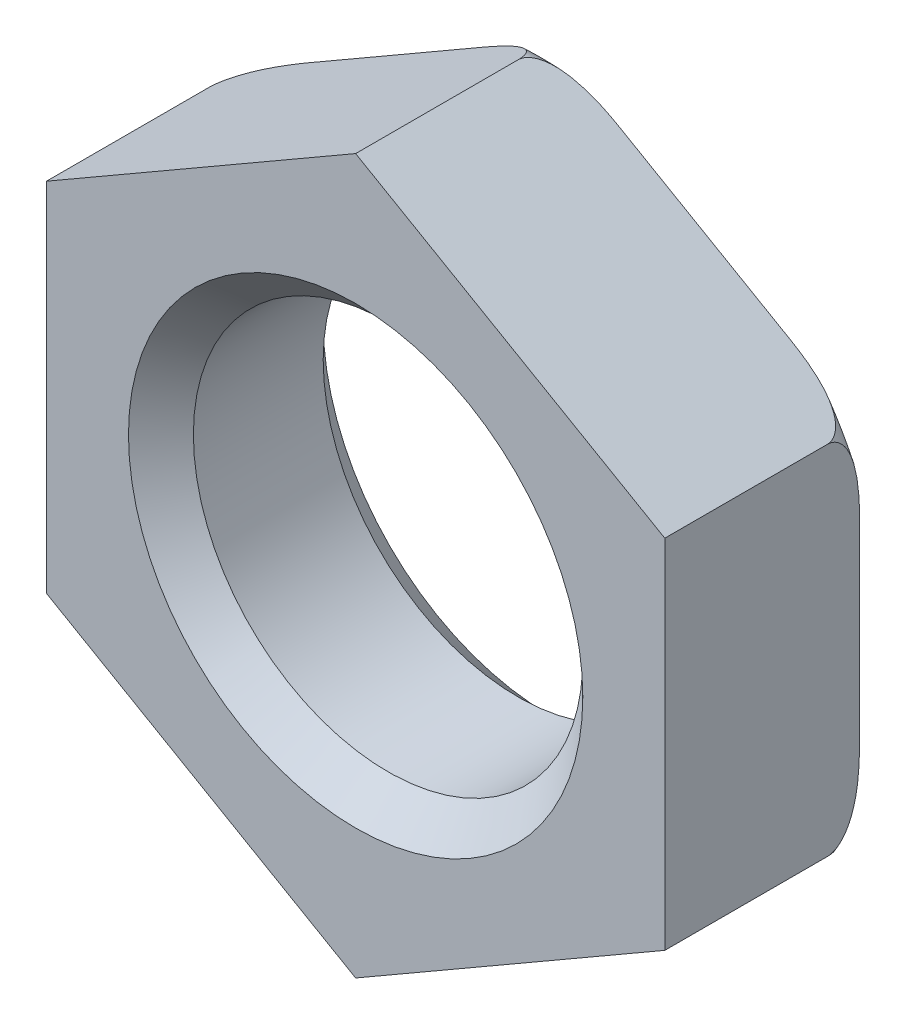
ISO-10303-21;
HEADER;
FILE_DESCRIPTION(('STEP AP214'),'2;1');
FILE_NAME('part.step','',(''),(''),'','','');
FILE_SCHEMA(('AUTOMOTIVE_DESIGN { 1 0 10303 214 1 1 1 1 }'));
ENDSEC;
DATA;
#1=APPLICATION_CONTEXT('core data for automotive mechanical design processes');
#2=APPLICATION_PROTOCOL_DEFINITION('international standard','automotive_design',2000,#1);
#3=PRODUCT_CONTEXT('',#1,'mechanical');
#4=PRODUCT('Part','Part','',(#3));
#5=PRODUCT_RELATED_PRODUCT_CATEGORY('part','',(#4));
#6=PRODUCT_DEFINITION_FORMATION('','',#4);
#7=PRODUCT_DEFINITION_CONTEXT('part definition',#1,'design');
#8=PRODUCT_DEFINITION('design','',#6,#7);
#9=PRODUCT_DEFINITION_SHAPE('','',#8);
#10=(LENGTH_UNIT() NAMED_UNIT(*) SI_UNIT(.MILLI.,.METRE.));
#11=(NAMED_UNIT(*) PLANE_ANGLE_UNIT() SI_UNIT($,.RADIAN.));
#12=(NAMED_UNIT(*) SI_UNIT($,.STERADIAN.) SOLID_ANGLE_UNIT());
#13=UNCERTAINTY_MEASURE_WITH_UNIT(LENGTH_MEASURE(1.E-05),#10,'distance_accuracy_value','');
#14=(GEOMETRIC_REPRESENTATION_CONTEXT(3) GLOBAL_UNCERTAINTY_ASSIGNED_CONTEXT((#13)) GLOBAL_UNIT_ASSIGNED_CONTEXT((#10,
#11,#12)) REPRESENTATION_CONTEXT('',''));
#15=CARTESIAN_POINT('',(0.,0.,0.));
#16=DIRECTION('',(0.,0.,1.));
#17=DIRECTION('',(1.,0.,0.));
#18=AXIS2_PLACEMENT_3D('',#15,#16,#17);
#19=CARTESIAN_POINT('',(4.76313972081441,8.25,3.));
#20=DIRECTION('',(0.,0.,-1.));
#21=DIRECTION('',(-1.,0.,0.));
#22=AXIS2_PLACEMENT_3D('',#19,#20,#21);
#23=PLANE('',#22);
#24=CARTESIAN_POINT('',(0.,0.,3.));
#25=DIRECTION('',(0.,0.,-1.));
#26=DIRECTION('',(-1.,0.,0.));
#27=AXIS2_PLACEMENT_3D('',#24,#25,#26);
#28=CIRCLE('',#27,3.5);
#29=CARTESIAN_POINT('',(-3.5,0.,3.));
#30=VERTEX_POINT('',#29);
#31=EDGE_CURVE('E165',#30,#30,#28,.T.);
#32=ORIENTED_EDGE('',*,*,#31,.T.);
#33=EDGE_LOOP('',(#32));
#34=FACE_BOUND('',#33,.T.);
#35=DIRECTION('',(-0.866025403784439,-0.5,0.));
#36=VECTOR('',#35,1.);
#37=CARTESIAN_POINT('',(-4.76313972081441,2.75,3.));
#38=LINE('',#37,#36);
#39=CARTESIAN_POINT('',(0.,5.5,3.));
#40=VERTEX_POINT('',#39);
#41=CARTESIAN_POINT('',(-4.76313972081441,2.75,3.));
#42=VERTEX_POINT('',#41);
#43=EDGE_CURVE('E181',#40,#42,#38,.T.);
#44=ORIENTED_EDGE('',*,*,#43,.T.);
#45=DIRECTION('',(0.,-1.,0.));
#46=VECTOR('',#45,1.);
#47=CARTESIAN_POINT('',(-4.76313972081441,-2.75,3.));
#48=LINE('',#47,#46);
#49=CARTESIAN_POINT('',(-4.76313972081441,-2.75,3.));
#50=VERTEX_POINT('',#49);
#51=EDGE_CURVE('E148',#42,#50,#48,.T.);
#52=ORIENTED_EDGE('',*,*,#51,.T.);
#53=DIRECTION('',(0.866025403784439,-0.5,0.));
#54=VECTOR('',#53,1.);
#55=CARTESIAN_POINT('',(0.,-5.5,3.));
#56=LINE('',#55,#54);
#57=CARTESIAN_POINT('',(0.,-5.5,3.));
#58=VERTEX_POINT('',#57);
#59=EDGE_CURVE('E207',#50,#58,#56,.T.);
#60=ORIENTED_EDGE('',*,*,#59,.T.);
#61=DIRECTION('',(0.866025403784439,0.5,0.));
#62=VECTOR('',#61,1.);
#63=CARTESIAN_POINT('',(4.76313972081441,-2.75,3.));
#64=LINE('',#63,#62);
#65=CARTESIAN_POINT('',(4.76313972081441,-2.75,3.));
#66=VERTEX_POINT('',#65);
#67=EDGE_CURVE('E202',#58,#66,#64,.T.);
#68=ORIENTED_EDGE('',*,*,#67,.T.);
#69=DIRECTION('',(0.,1.,0.));
#70=VECTOR('',#69,1.);
#71=CARTESIAN_POINT('',(4.76313972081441,2.75,3.));
#72=LINE('',#71,#70);
#73=CARTESIAN_POINT('',(4.76313972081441,2.75,3.));
#74=VERTEX_POINT('',#73);
#75=EDGE_CURVE('E187',#66,#74,#72,.T.);
#76=ORIENTED_EDGE('',*,*,#75,.T.);
#77=DIRECTION('',(-0.866025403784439,0.5,0.));
#78=VECTOR('',#77,1.);
#79=CARTESIAN_POINT('',(0.,5.5,3.));
#80=LINE('',#79,#78);
#81=EDGE_CURVE('E183',#74,#40,#80,.T.);
#82=ORIENTED_EDGE('',*,*,#81,.T.);
#83=EDGE_LOOP('',(#44,#52,#60,#68,#76,#82));
#84=FACE_BOUND('',#83,.T.);
#85=ADVANCED_FACE('F32',(#34,#84),#23,.F.);
#86=CARTESIAN_POINT('',(4.76313972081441,8.25,0.));
#87=DIRECTION('',(0.,0.,-1.));
#88=DIRECTION('',(-1.,0.,0.));
#89=AXIS2_PLACEMENT_3D('',#86,#87,#88);
#90=PLANE('',#89);
#91=CARTESIAN_POINT('',(0.,0.,0.));
#92=DIRECTION('',(0.,0.,-1.));
#93=DIRECTION('',(-1.,0.,0.));
#94=AXIS2_PLACEMENT_3D('',#91,#92,#93);
#95=CIRCLE('',#94,5.);
#96=CARTESIAN_POINT('',(-3.69852657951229,-3.36465468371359,0.));
#97=VERTEX_POINT('',#96);
#98=CARTESIAN_POINT('',(-4.76313972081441,-1.52069063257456,0.));
#99=VERTEX_POINT('',#98);
#100=EDGE_CURVE('E62',#97,#99,#95,.T.);
#101=ORIENTED_EDGE('',*,*,#100,.T.);
#102=DIRECTION('',(0.,-1.,0.));
#103=VECTOR('',#102,1.);
#104=CARTESIAN_POINT('',(-4.76313972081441,-2.75,0.));
#105=LINE('',#104,#103);
#106=CARTESIAN_POINT('',(-4.76313972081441,1.52069063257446,0.));
#107=VERTEX_POINT('',#106);
#108=EDGE_CURVE('E330',#107,#99,#105,.T.);
#109=ORIENTED_EDGE('',*,*,#108,.F.);
#110=CARTESIAN_POINT('',(-3.6985265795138,3.36465468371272,0.));
#111=VERTEX_POINT('',#110);
#112=EDGE_CURVE('E54',#107,#111,#95,.T.);
#113=ORIENTED_EDGE('',*,*,#112,.T.);
#114=DIRECTION('',(-0.866025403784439,-0.5,0.));
#115=VECTOR('',#114,1.);
#116=CARTESIAN_POINT('',(-4.76313972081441,2.75,0.));
#117=LINE('',#116,#115);
#118=CARTESIAN_POINT('',(-1.06461314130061,4.88534531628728,0.));
#119=VERTEX_POINT('',#118);
#120=EDGE_CURVE('E143',#119,#111,#117,.T.);
#121=ORIENTED_EDGE('',*,*,#120,.F.);
#122=CARTESIAN_POINT('',(1.06461314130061,4.88534531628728,0.));
#123=VERTEX_POINT('',#122);
#124=EDGE_CURVE('E313',#119,#123,#95,.T.);
#125=ORIENTED_EDGE('',*,*,#124,.T.);
#126=DIRECTION('',(-0.866025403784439,0.5,0.));
#127=VECTOR('',#126,1.);
#128=CARTESIAN_POINT('',(0.,5.5,0.));
#129=LINE('',#128,#127);
#130=CARTESIAN_POINT('',(3.69852657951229,3.36465468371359,0.));
#131=VERTEX_POINT('',#130);
#132=EDGE_CURVE('E178',#131,#123,#129,.T.);
#133=ORIENTED_EDGE('',*,*,#132,.F.);
#134=CARTESIAN_POINT('',(4.76313972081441,1.52069063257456,0.));
#135=VERTEX_POINT('',#134);
#136=EDGE_CURVE('E310',#131,#135,#95,.T.);
#137=ORIENTED_EDGE('',*,*,#136,.T.);
#138=DIRECTION('',(0.,1.,0.));
#139=VECTOR('',#138,1.);
#140=CARTESIAN_POINT('',(4.76313972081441,2.75,0.));
#141=LINE('',#140,#139);
#142=CARTESIAN_POINT('',(4.76313972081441,-1.52069063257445,0.));
#143=VERTEX_POINT('',#142);
#144=EDGE_CURVE('E316',#143,#135,#141,.T.);
#145=ORIENTED_EDGE('',*,*,#144,.F.);
#146=CARTESIAN_POINT('',(3.6985265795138,-3.36465468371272,0.));
#147=VERTEX_POINT('',#146);
#148=EDGE_CURVE('E314',#143,#147,#95,.T.);
#149=ORIENTED_EDGE('',*,*,#148,.T.);
#150=DIRECTION('',(0.866025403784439,0.5,0.));
#151=VECTOR('',#150,1.);
#152=CARTESIAN_POINT('',(4.76313972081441,-2.75,0.));
#153=LINE('',#152,#151);
#154=CARTESIAN_POINT('',(1.06461314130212,-4.88534531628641,0.));
#155=VERTEX_POINT('',#154);
#156=EDGE_CURVE('E319',#155,#147,#153,.T.);
#157=ORIENTED_EDGE('',*,*,#156,.F.);
#158=CARTESIAN_POINT('',(-1.06461314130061,-4.88534531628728,0.));
#159=VERTEX_POINT('',#158);
#160=EDGE_CURVE('E328',#155,#159,#95,.T.);
#161=ORIENTED_EDGE('',*,*,#160,.T.);
#162=DIRECTION('',(0.866025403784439,-0.5,0.));
#163=VECTOR('',#162,1.);
#164=CARTESIAN_POINT('',(0.,-5.5,0.));
#165=LINE('',#164,#163);
#166=EDGE_CURVE('E211',#97,#159,#165,.T.);
#167=ORIENTED_EDGE('',*,*,#166,.F.);
#168=EDGE_LOOP('',(#101,#109,#113,#121,#125,#133,#137,#145,#149,#157,#161,#167));
#169=FACE_BOUND('',#168,.T.);
#170=CARTESIAN_POINT('',(0.,0.,0.));
#171=DIRECTION('',(0.,0.,-1.));
#172=DIRECTION('',(-1.,0.,0.));
#173=AXIS2_PLACEMENT_3D('',#170,#171,#172);
#174=CIRCLE('',#173,3.5);
#175=CARTESIAN_POINT('',(-3.5,0.,0.));
#176=VERTEX_POINT('',#175);
#177=EDGE_CURVE('E150',#176,#176,#174,.F.);
#178=ORIENTED_EDGE('',*,*,#177,.T.);
#179=EDGE_LOOP('',(#178));
#180=FACE_BOUND('',#179,.T.);
#181=ADVANCED_FACE('F270',(#169,#180),#90,.T.);
#182=CARTESIAN_POINT('',(-4.76313972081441,2.75,3.));
#183=DIRECTION('',(0.5,-0.866025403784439,0.));
#184=DIRECTION('',(0.866025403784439,0.5,0.));
#185=AXIS2_PLACEMENT_3D('',#182,#183,#184);
#186=PLANE('',#185);
#187=DIRECTION('',(0.,0.,-1.));
#188=VECTOR('',#187,1.);
#189=CARTESIAN_POINT('',(0.,5.5,3.));
#190=LINE('',#189,#188);
#191=CARTESIAN_POINT('',(0.,5.5,0.499999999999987));
#192=VERTEX_POINT('',#191);
#193=EDGE_CURVE('E176',#40,#192,#190,.T.);
#194=ORIENTED_EDGE('',*,*,#193,.T.);
#195=CARTESIAN_POINT('',(-6.92820345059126E-08,5.49999996,0.5002));
#196=CARTESIAN_POINT('',(4.17344779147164E-05,5.50002409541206,0.485171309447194));
#197=CARTESIAN_POINT('',(-0.00115099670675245,5.49933547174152,0.470181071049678));
#198=CARTESIAN_POINT('',(-0.00573134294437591,5.49669100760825,0.440784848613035));
#199=CARTESIAN_POINT('',(-0.00909949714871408,5.4947464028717,0.42637487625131));
#200=CARTESIAN_POINT('',(-0.0177519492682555,5.48975090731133,0.398409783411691));
#201=CARTESIAN_POINT('',(-0.0230305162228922,5.48670332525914,0.384852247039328));
#202=CARTESIAN_POINT('',(-0.035164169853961,5.47969795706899,0.358690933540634));
#203=CARTESIAN_POINT('',(-0.0420229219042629,5.47573805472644,0.346089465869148));
#204=CARTESIAN_POINT('',(-0.0621464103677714,5.464119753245,0.313593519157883));
#205=CARTESIAN_POINT('',(-0.0765689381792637,5.45579290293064,0.294656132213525));
#206=CARTESIAN_POINT('',(-0.107752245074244,5.4377892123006,0.259561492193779));
#207=CARTESIAN_POINT('',(-0.124519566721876,5.42810859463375,0.243412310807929));
#208=CARTESIAN_POINT('',(-0.172791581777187,5.40023873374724,0.202276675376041));
#209=CARTESIAN_POINT('',(-0.205883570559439,5.38113306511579,0.179796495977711));
#210=CARTESIAN_POINT('',(-0.274427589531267,5.34155915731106,0.140453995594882));
#211=CARTESIAN_POINT('',(-0.309884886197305,5.32108787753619,0.123604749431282));
#212=CARTESIAN_POINT('',(-0.393111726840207,5.27303683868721,0.0897261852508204));
#213=CARTESIAN_POINT('',(-0.441336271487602,5.24519438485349,0.0742113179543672));
#214=CARTESIAN_POINT('',(-0.538871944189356,5.18888213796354,0.0485296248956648));
#215=CARTESIAN_POINT('',(-0.588185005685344,5.16041122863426,0.0383732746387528));
#216=CARTESIAN_POINT('',(-0.687496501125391,5.10307371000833,0.022094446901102));
#217=CARTESIAN_POINT('',(-0.737496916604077,5.07420595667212,0.0159886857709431));
#218=CARTESIAN_POINT('',(-0.837718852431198,5.01634279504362,0.00690695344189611));
#219=CARTESIAN_POINT('',(-0.887940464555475,4.98734733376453,0.00393243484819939));
#220=CARTESIAN_POINT('',(-0.991943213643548,4.92730131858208,0.000242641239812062));
#221=CARTESIAN_POINT('',(-1.04572839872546,4.89624842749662,-0.000300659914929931));
#222=CARTESIAN_POINT('',(-1.15328992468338,4.83414775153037,0.000593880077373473));
#223=CARTESIAN_POINT('',(-1.20706626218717,4.80309996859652,0.00203208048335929));
#224=CARTESIAN_POINT('',(-1.36843238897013,4.70993519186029,0.00835027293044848));
#225=CARTESIAN_POINT('',(-1.4759542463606,4.64785741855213,0.015234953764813));
#226=CARTESIAN_POINT('',(-1.69057777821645,4.52394446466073,0.0298769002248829));
#227=CARTESIAN_POINT('',(-1.79767965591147,4.4621091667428,0.0376311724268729));
#228=CARTESIAN_POINT('',(-1.95839919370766,4.36931769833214,0.0472242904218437));
#229=CARTESIAN_POINT('',(-2.01196594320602,4.33839092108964,0.0500816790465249));
#230=CARTESIAN_POINT('',(-2.11913178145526,4.27651869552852,0.0547883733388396));
#231=CARTESIAN_POINT('',(-2.17273086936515,4.24557324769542,0.0566377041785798));
#232=CARTESIAN_POINT('',(-2.29656035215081,4.17408026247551,0.0594736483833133));
#233=CARTESIAN_POINT('',(-2.3667991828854,4.13352785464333,0.06001553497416));
#234=CARTESIAN_POINT('',(-2.50727421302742,4.05242455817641,0.058846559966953));
#235=CARTESIAN_POINT('',(-2.57751040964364,4.01187367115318,0.0571352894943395));
#236=CARTESIAN_POINT('',(-2.7180149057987,3.93075336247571,0.0518150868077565));
#237=CARTESIAN_POINT('',(-2.78828313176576,3.89018398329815,0.0482037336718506));
#238=CARTESIAN_POINT('',(-2.9287633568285,3.80907768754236,0.039824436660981));
#239=CARTESIAN_POINT('',(-2.99897535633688,3.76854077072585,0.0350565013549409));
#240=CARTESIAN_POINT('',(-3.16115399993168,3.67490688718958,0.0238380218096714));
#241=CARTESIAN_POINT('',(-3.25311741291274,3.62181178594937,0.0173240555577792));
#242=CARTESIAN_POINT('',(-3.43713195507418,3.51557094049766,0.00656596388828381));
#243=CARTESIAN_POINT('',(-3.5291830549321,3.46242521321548,0.00232124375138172));
#244=CARTESIAN_POINT('',(-3.7087939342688,3.35872682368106,-0.000845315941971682));
#245=CARTESIAN_POINT('',(-3.79634737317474,3.30817782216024,-2.34943633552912E-05));
#246=CARTESIAN_POINT('',(-3.92748150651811,3.23246749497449,0.0072194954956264));
#247=CARTESIAN_POINT('',(-3.97117778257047,3.20723943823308,0.0106381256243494));
#248=CARTESIAN_POINT('',(-4.05835067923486,3.15691014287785,0.0200327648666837));
#249=CARTESIAN_POINT('',(-4.10182736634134,3.13180886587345,0.0260079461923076));
#250=CARTESIAN_POINT('',(-4.20054063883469,3.07481673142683,0.0433077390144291));
#251=CARTESIAN_POINT('',(-4.25565633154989,3.04299567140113,0.0556625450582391));
#252=CARTESIAN_POINT('',(-4.33707474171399,2.9959887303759,0.0796465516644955));
#253=CARTESIAN_POINT('',(-4.36398189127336,2.98045388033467,0.0885396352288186));
#254=CARTESIAN_POINT('',(-4.41717740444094,2.94974143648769,0.108502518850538));
#255=CARTESIAN_POINT('',(-4.44346615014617,2.93456362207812,0.119570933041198));
#256=CARTESIAN_POINT('',(-4.49494978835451,2.90483952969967,0.144255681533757));
#257=CARTESIAN_POINT('',(-4.52015055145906,2.89028986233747,0.157855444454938));
#258=CARTESIAN_POINT('',(-4.56912102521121,2.86201674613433,0.188236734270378));
#259=CARTESIAN_POINT('',(-4.59289057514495,2.84829339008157,0.20501861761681));
#260=CARTESIAN_POINT('',(-4.63335870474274,2.82492910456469,0.238589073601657));
#261=CARTESIAN_POINT('',(-4.65050151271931,2.81503169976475,0.254654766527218));
#262=CARTESIAN_POINT('',(-4.68248903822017,2.79656369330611,0.289619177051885));
#263=CARTESIAN_POINT('',(-4.69733849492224,2.78799035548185,0.308511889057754));
#264=CARTESIAN_POINT('',(-4.71908284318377,2.77543625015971,0.342414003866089));
#265=CARTESIAN_POINT('',(-4.7269683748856,2.77088353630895,0.356571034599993));
#266=CARTESIAN_POINT('',(-4.74071619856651,2.76294622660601,0.386110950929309));
#267=CARTESIAN_POINT('',(-4.74658502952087,2.75955785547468,0.401489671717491));
#268=CARTESIAN_POINT('',(-4.75507046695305,2.75465878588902,0.430628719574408));
#269=CARTESIAN_POINT('',(-4.7580621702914,2.75293152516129,0.444241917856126));
#270=CARTESIAN_POINT('',(-4.76212200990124,2.75058757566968,0.471957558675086));
#271=CARTESIAN_POINT('',(-4.76317393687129,2.74998024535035,0.486063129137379));
#272=CARTESIAN_POINT('',(-4.76313965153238,2.75000004,0.500200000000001));
#273=B_SPLINE_CURVE_WITH_KNOTS('',3,(#195,#196,#197,#198,#199,#200,#201,#202,#203,#204,#205,
#206,#207,#208,#209,#210,#211,#212,#213,#214,#215,#216,#217,#218,#219,#220,#221,#222,#223,#224,
#225,#226,#227,#228,#229,#230,#231,#232,#233,#234,#235,#236,#237,#238,#239,#240,#241,#242,#243,
#244,#245,#246,#247,#248,#249,#250,#251,#252,#253,#254,#255,#256,#257,#258,#259,#260,#261,#262,
#263,#264,#265,#266,#267,#268,#269,#270,#271,#272),.UNSPECIFIED.,.F.,.F.,(4,2,2,2,2,2,2,2,2,2,2,
2,2,2,2,2,2,2,2,2,2,2,2,2,2,2,2,2,2,2,2,2,2,2,2,2,2,2,4),(0.,0.0449591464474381,
0.0895215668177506,0.133951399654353,0.178485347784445,0.253702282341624,0.3291334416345,
0.461383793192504,0.593939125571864,0.766949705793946,0.940297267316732,1.11435583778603,
1.28849511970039,1.474775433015,1.66108952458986,2.03408119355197,2.40582618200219,
2.59157707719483,2.77732333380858,3.02061058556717,3.26394199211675,3.50758418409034,
3.75122457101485,4.07039121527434,4.3894741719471,4.69255042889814,4.84421083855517,
4.99582217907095,5.18994594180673,5.2868374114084,5.38366735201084,5.47988437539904,
5.57611218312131,5.65238754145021,5.72850310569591,5.77883559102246,5.82900330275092,
5.87095935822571,5.9132644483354),.UNSPECIFIED.);
#274=EDGE_CURVE('E145',#192,#119,#273,.T.);
#275=ORIENTED_EDGE('',*,*,#274,.T.);
#276=ORIENTED_EDGE('',*,*,#120,.T.);
#277=CARTESIAN_POINT('',(-4.76313972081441,2.75,0.5));
#278=VERTEX_POINT('',#277);
#279=EDGE_CURVE('E128',#111,#278,#273,.T.);
#280=ORIENTED_EDGE('',*,*,#279,.T.);
#281=DIRECTION('',(0.,0.,-1.));
#282=VECTOR('',#281,1.);
#283=CARTESIAN_POINT('',(-4.76313972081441,2.75,3.));
#284=LINE('',#283,#282);
#285=EDGE_CURVE('E140',#42,#278,#284,.T.);
#286=ORIENTED_EDGE('',*,*,#285,.F.);
#287=ORIENTED_EDGE('',*,*,#43,.F.);
#288=EDGE_LOOP('',(#194,#275,#276,#280,#286,#287));
#289=FACE_BOUND('',#288,.T.);
#290=ADVANCED_FACE('F34',(#289),#186,.F.);
#291=CARTESIAN_POINT('',(-4.76313972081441,-2.75,3.));
#292=DIRECTION('',(1.,0.,0.));
#293=DIRECTION('',(0.,0.,-1.));
#294=AXIS2_PLACEMENT_3D('',#291,#292,#293);
#295=PLANE('',#294);
#296=ORIENTED_EDGE('',*,*,#108,.T.);
#297=CARTESIAN_POINT('',(-4.76313972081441,0.,0.0596623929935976));
#298=CARTESIAN_POINT('',(-4.76313972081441,-0.0833123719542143,0.0596615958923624));
#299=CARTESIAN_POINT('',(-4.76313972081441,-0.166624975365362,0.0584640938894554));
#300=CARTESIAN_POINT('',(-4.76313972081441,-0.333193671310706,0.053937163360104));
#301=CARTESIAN_POINT('',(-4.76313972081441,-0.416449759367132,0.0506075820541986));
#302=CARTESIAN_POINT('',(-4.76313972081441,-0.583102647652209,0.042529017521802));
#303=CARTESIAN_POINT('',(-4.76313972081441,-0.66649925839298,0.0377764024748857));
#304=CARTESIAN_POINT('',(-4.76313972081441,-0.833255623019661,0.0278853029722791));
#305=CARTESIAN_POINT('',(-4.76313972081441,-0.916615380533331,0.0227468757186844));
#306=CARTESIAN_POINT('',(-4.76313972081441,-1.07207886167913,0.0139318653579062));
#307=CARTESIAN_POINT('',(-4.76313972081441,-1.1441763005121,0.0101515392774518));
#308=CARTESIAN_POINT('',(-4.76313972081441,-1.28843155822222,0.00406703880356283));
#309=CARTESIAN_POINT('',(-4.76313972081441,-1.3605893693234,0.00176269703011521));
#310=CARTESIAN_POINT('',(-4.76313972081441,-1.50473132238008,-0.000402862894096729));
#311=CARTESIAN_POINT('',(-4.76313972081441,-1.57671531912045,-0.000271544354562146));
#312=CARTESIAN_POINT('',(-4.76313972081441,-1.72057648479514,0.00353962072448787));
#313=CARTESIAN_POINT('',(-4.76313972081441,-1.79245368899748,0.00721770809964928));
#314=CARTESIAN_POINT('',(-4.76313972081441,-1.9244563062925,0.0185802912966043));
#315=CARTESIAN_POINT('',(-4.76313972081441,-1.9846399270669,0.0255379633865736));
#316=CARTESIAN_POINT('',(-4.76313972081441,-2.1045235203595,0.0441758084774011));
#317=CARTESIAN_POINT('',(-4.76313972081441,-2.16422085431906,0.0558734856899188));
#318=CARTESIAN_POINT('',(-4.76313972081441,-2.28289799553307,0.0858428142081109));
#319=CARTESIAN_POINT('',(-4.76313972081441,-2.34185887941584,0.104196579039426));
#320=CARTESIAN_POINT('',(-4.76313972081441,-2.4273789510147,0.138588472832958));
#321=CARTESIAN_POINT('',(-4.76313972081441,-2.45532806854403,0.15115340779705));
#322=CARTESIAN_POINT('',(-4.76313972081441,-2.50978856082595,0.179056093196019));
#323=CARTESIAN_POINT('',(-4.76313972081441,-2.53630239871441,0.194388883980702));
#324=CARTESIAN_POINT('',(-4.76313972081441,-2.5784342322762,0.222626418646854));
#325=CARTESIAN_POINT('',(-4.76313972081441,-2.59468742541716,0.234579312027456));
#326=CARTESIAN_POINT('',(-4.76313972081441,-2.62586063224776,0.260165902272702));
#327=CARTESIAN_POINT('',(-4.76313972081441,-2.64077941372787,0.273801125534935));
#328=CARTESIAN_POINT('',(-4.76313972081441,-2.66885544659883,0.303057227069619));
#329=CARTESIAN_POINT('',(-4.76313972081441,-2.6819947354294,0.318695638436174));
#330=CARTESIAN_POINT('',(-4.76313972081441,-2.70553305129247,0.351924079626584));
#331=CARTESIAN_POINT('',(-4.76313972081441,-2.71593769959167,0.369509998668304));
#332=CARTESIAN_POINT('',(-4.76313972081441,-2.73075899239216,0.401515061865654));
#333=CARTESIAN_POINT('',(-4.76313972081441,-2.7360320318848,0.415535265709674));
#334=CARTESIAN_POINT('',(-4.76313972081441,-2.7441853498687,0.444256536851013));
#335=CARTESIAN_POINT('',(-4.76313972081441,-2.74706791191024,0.45895694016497));
#336=CARTESIAN_POINT('',(-4.76313972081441,-2.75019021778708,0.488703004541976));
#337=CARTESIAN_POINT('',(-4.76313972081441,-2.75041898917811,0.5037498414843));
#338=CARTESIAN_POINT('',(-4.76313972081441,-2.74818220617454,0.53364244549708));
#339=CARTESIAN_POINT('',(-4.76313972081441,-2.74571582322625,0.54848814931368));
#340=CARTESIAN_POINT('',(-4.76313972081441,-2.73850974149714,0.576795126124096));
#341=CARTESIAN_POINT('',(-4.76313972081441,-2.73389271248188,0.590288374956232));
#342=CARTESIAN_POINT('',(-4.76313972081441,-2.72276668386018,0.616461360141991));
#343=CARTESIAN_POINT('',(-4.76313972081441,-2.71625694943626,0.629140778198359));
#344=CARTESIAN_POINT('',(-4.76313972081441,-2.69753848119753,0.660538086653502));
#345=CARTESIAN_POINT('',(-4.76313972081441,-2.68419613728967,0.678579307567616));
#346=CARTESIAN_POINT('',(-4.76313972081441,-2.65485960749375,0.712357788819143));
#347=CARTESIAN_POINT('',(-4.76313972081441,-2.63885804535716,0.728088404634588));
#348=CARTESIAN_POINT('',(-4.76313972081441,-2.59368207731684,0.767321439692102));
#349=CARTESIAN_POINT('',(-4.76313972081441,-2.56288435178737,0.788938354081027));
#350=CARTESIAN_POINT('',(-4.76313972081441,-2.49853010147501,0.827508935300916));
#351=CARTESIAN_POINT('',(-4.76313972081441,-2.46496657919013,0.844450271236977));
#352=CARTESIAN_POINT('',(-4.76313972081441,-2.39593018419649,0.874772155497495));
#353=CARTESIAN_POINT('',(-4.76313972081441,-2.36044267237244,0.888118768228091));
#354=CARTESIAN_POINT('',(-4.76313972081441,-2.28846263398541,0.911799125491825));
#355=CARTESIAN_POINT('',(-4.76313972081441,-2.25196909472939,0.922129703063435));
#356=CARTESIAN_POINT('',(-4.76313972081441,-2.14153381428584,0.949471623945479));
#357=CARTESIAN_POINT('',(-4.76313972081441,-2.06669076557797,0.962812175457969));
#358=CARTESIAN_POINT('',(-4.76313972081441,-1.91420642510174,0.983036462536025));
#359=CARTESIAN_POINT('',(-4.76313972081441,-1.83654400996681,0.989736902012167));
#360=CARTESIAN_POINT('',(-4.76313972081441,-1.68091105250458,0.998189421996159));
#361=CARTESIAN_POINT('',(-4.76313972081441,-1.60294030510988,0.999937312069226));
#362=CARTESIAN_POINT('',(-4.76313972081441,-1.44687769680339,1.00005938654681));
#363=CARTESIAN_POINT('',(-4.76313972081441,-1.36878587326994,0.998427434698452));
#364=CARTESIAN_POINT('',(-4.76313972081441,-1.21269784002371,0.993067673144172));
#365=CARTESIAN_POINT('',(-4.76313972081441,-1.13470161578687,0.989340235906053));
#366=CARTESIAN_POINT('',(-4.76313972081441,-0.979557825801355,0.980955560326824));
#367=CARTESIAN_POINT('',(-4.76313972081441,-0.902409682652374,0.97630814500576));
#368=CARTESIAN_POINT('',(-4.76313972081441,-0.748111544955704,0.967043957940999));
#369=CARTESIAN_POINT('',(-4.76313972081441,-0.670961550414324,0.962427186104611));
#370=CARTESIAN_POINT('',(-4.76313972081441,-0.516647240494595,0.954097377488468));
#371=CARTESIAN_POINT('',(-4.76313972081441,-0.439482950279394,0.950383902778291));
#372=CARTESIAN_POINT('',(-4.76313972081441,-0.285094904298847,0.944547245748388));
#373=CARTESIAN_POINT('',(-4.76313972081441,-0.207871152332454,0.942423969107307));
#374=CARTESIAN_POINT('',(-4.76313972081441,-0.0536357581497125,0.940172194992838));
#375=CARTESIAN_POINT('',(-4.76313972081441,0.0233757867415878,0.940037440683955));
#376=CARTESIAN_POINT('',(-4.76313972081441,0.177376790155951,0.941772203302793));
#377=CARTESIAN_POINT('',(-4.76313972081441,0.25436624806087,0.943641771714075));
#378=CARTESIAN_POINT('',(-4.76313972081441,0.408324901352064,0.949034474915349));
#379=CARTESIAN_POINT('',(-4.76313972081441,0.48529406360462,0.952558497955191));
#380=CARTESIAN_POINT('',(-4.76313972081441,0.63918055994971,0.96060918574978));
#381=CARTESIAN_POINT('',(-4.76313972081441,0.716097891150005,0.965135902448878));
#382=CARTESIAN_POINT('',(-4.76313972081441,0.858735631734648,0.973677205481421));
#383=CARTESIAN_POINT('',(-4.76313972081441,0.924457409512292,0.97767051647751));
#384=CARTESIAN_POINT('',(-4.76313972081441,1.05592353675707,0.985175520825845));
#385=CARTESIAN_POINT('',(-4.76313972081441,1.12166788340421,0.988687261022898));
#386=CARTESIAN_POINT('',(-4.76313972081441,1.25358193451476,0.994598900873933));
#387=CARTESIAN_POINT('',(-4.76313972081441,1.31975194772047,0.996992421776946));
#388=CARTESIAN_POINT('',(-4.76313972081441,1.45212589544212,0.999910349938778));
#389=CARTESIAN_POINT('',(-4.76313972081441,1.51832981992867,1.00043514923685));
#390=CARTESIAN_POINT('',(-4.76313972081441,1.65172937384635,0.998769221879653));
#391=CARTESIAN_POINT('',(-4.76313972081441,1.71892470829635,0.996536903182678));
#392=CARTESIAN_POINT('',(-4.76313972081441,1.85305945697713,0.988219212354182));
#393=CARTESIAN_POINT('',(-4.76313972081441,1.91999898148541,0.982135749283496));
#394=CARTESIAN_POINT('',(-4.76313972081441,2.05279268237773,0.964778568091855));
#395=CARTESIAN_POINT('',(-4.76313972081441,2.11865118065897,0.953541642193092));
#396=CARTESIAN_POINT('',(-4.76313972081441,2.21614450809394,0.931320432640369));
#397=CARTESIAN_POINT('',(-4.76313972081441,2.24839183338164,0.92303109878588));
#398=CARTESIAN_POINT('',(-4.76313972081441,2.31225221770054,0.904310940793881));
#399=CARTESIAN_POINT('',(-4.76313972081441,2.34386560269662,0.893881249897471));
#400=CARTESIAN_POINT('',(-4.76313972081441,2.40913899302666,0.869310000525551));
#401=CARTESIAN_POINT('',(-4.76313972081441,2.44270261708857,0.854907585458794));
#402=CARTESIAN_POINT('',(-4.76313972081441,2.50793388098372,0.822220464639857));
#403=CARTESIAN_POINT('',(-4.76313972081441,2.53960283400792,0.803938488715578));
#404=CARTESIAN_POINT('',(-4.76313972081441,2.59027720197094,0.768928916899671));
#405=CARTESIAN_POINT('',(-4.76313972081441,2.61015981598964,0.753483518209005));
#406=CARTESIAN_POINT('',(-4.76313972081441,2.64751914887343,0.71988704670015));
#407=CARTESIAN_POINT('',(-4.76313972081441,2.66499990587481,0.701740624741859));
#408=CARTESIAN_POINT('',(-4.76313972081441,2.69152700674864,0.668472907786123));
#409=CARTESIAN_POINT('',(-4.76313972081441,2.70152084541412,0.654112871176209));
#410=CARTESIAN_POINT('',(-4.76313972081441,2.7191439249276,0.624002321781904));
#411=CARTESIAN_POINT('',(-4.76313972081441,2.72677673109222,0.608253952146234));
#412=CARTESIAN_POINT('',(-4.76313972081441,2.73805838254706,0.578239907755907));
#413=CARTESIAN_POINT('',(-4.76313972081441,2.74215015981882,0.564142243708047));
#414=CARTESIAN_POINT('',(-4.76313972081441,2.74789838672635,0.535456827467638));
#415=CARTESIAN_POINT('',(-4.76313972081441,2.74955642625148,0.520869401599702));
#416=CARTESIAN_POINT('',(-4.76313972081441,2.75028804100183,0.491601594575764));
#417=CARTESIAN_POINT('',(-4.76313972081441,2.74935679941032,0.476921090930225));
#418=CARTESIAN_POINT('',(-4.76313972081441,2.74498700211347,0.447938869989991));
#419=CARTESIAN_POINT('',(-4.76313972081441,2.7415472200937,0.433637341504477));
#420=CARTESIAN_POINT('',(-4.76313972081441,2.73251902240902,0.405987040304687));
#421=CARTESIAN_POINT('',(-4.76313972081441,2.7269645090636,0.392626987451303));
#422=CARTESIAN_POINT('',(-4.76313972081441,2.71406595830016,0.366812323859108));
#423=CARTESIAN_POINT('',(-4.76313972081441,2.70672130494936,0.354358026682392));
#424=CARTESIAN_POINT('',(-4.76313972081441,2.68519396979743,0.322407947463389));
#425=CARTESIAN_POINT('',(-4.76313972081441,2.66972502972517,0.303779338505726));
#426=CARTESIAN_POINT('',(-4.76313972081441,2.63609661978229,0.269127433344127));
#427=CARTESIAN_POINT('',(-4.76313972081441,2.61792865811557,0.253112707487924));
#428=CARTESIAN_POINT('',(-4.76313972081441,2.56598591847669,0.212609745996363));
#429=CARTESIAN_POINT('',(-4.76313972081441,2.53044952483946,0.19040116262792));
#430=CARTESIAN_POINT('',(-4.76313972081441,2.45664114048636,0.151262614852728));
#431=CARTESIAN_POINT('',(-4.76313972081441,2.41836323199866,0.134344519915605));
#432=CARTESIAN_POINT('',(-4.76313972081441,2.33855698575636,0.103949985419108));
#433=CARTESIAN_POINT('',(-4.76313972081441,2.29695973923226,0.0906579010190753));
#434=CARTESIAN_POINT('',(-4.76313972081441,2.21278702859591,0.0675619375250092));
#435=CARTESIAN_POINT('',(-4.76313972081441,2.17021046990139,0.0577621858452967));
#436=CARTESIAN_POINT('',(-4.76313972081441,2.08441385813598,0.0409438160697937));
#437=CARTESIAN_POINT('',(-4.76313972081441,2.04119246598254,0.0339321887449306));
#438=CARTESIAN_POINT('',(-4.76313972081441,1.95448412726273,0.0221974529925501));
#439=CARTESIAN_POINT('',(-4.76313972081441,1.91099741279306,0.0174725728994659));
#440=CARTESIAN_POINT('',(-4.76313972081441,1.78998763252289,0.00692007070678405));
#441=CARTESIAN_POINT('',(-4.76313972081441,1.71229294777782,0.00309196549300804));
#442=CARTESIAN_POINT('',(-4.76313972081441,1.55679891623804,-0.000525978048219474));
#443=CARTESIAN_POINT('',(-4.76313972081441,1.47899953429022,-0.00031323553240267));
#444=CARTESIAN_POINT('',(-4.76313972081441,1.3232759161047,0.0027738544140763));
#445=CARTESIAN_POINT('',(-4.76313972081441,1.24535183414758,0.00565465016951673));
#446=CARTESIAN_POINT('',(-4.76313972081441,1.08957099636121,0.0129005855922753));
#447=CARTESIAN_POINT('',(-4.76313972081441,1.01171425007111,0.0172659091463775));
#448=CARTESIAN_POINT('',(-4.76313972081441,0.856038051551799,0.0264222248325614));
#449=CARTESIAN_POINT('',(-4.76313972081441,0.778218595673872,0.0312131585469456));
#450=CARTESIAN_POINT('',(-4.76313972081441,0.622554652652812,0.0402676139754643));
#451=CARTESIAN_POINT('',(-4.76313972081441,0.544710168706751,0.0445311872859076));
#452=CARTESIAN_POINT('',(-4.76313972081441,0.389077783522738,0.0517203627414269));
#453=CARTESIAN_POINT('',(-4.76313972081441,0.31128998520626,0.0546480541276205));
#454=CARTESIAN_POINT('',(-4.76313972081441,0.155668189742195,0.0586193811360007));
#455=CARTESIAN_POINT('',(-4.76313972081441,0.0778341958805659,0.0596631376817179));
#456=CARTESIAN_POINT('',(-4.76313972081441,0.,0.0596623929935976));
#457=B_SPLINE_CURVE_WITH_KNOTS('',3,(#297,#298,#299,#300,#301,#302,#303,#304,#305,#306,#307,
#308,#309,#310,#311,#312,#313,#314,#315,#316,#317,#318,#319,#320,#321,#322,#323,#324,#325,#326,
#327,#328,#329,#330,#331,#332,#333,#334,#335,#336,#337,#338,#339,#340,#341,#342,#343,#344,#345,
#346,#347,#348,#349,#350,#351,#352,#353,#354,#355,#356,#357,#358,#359,#360,#361,#362,#363,#364,
#365,#366,#367,#368,#369,#370,#371,#372,#373,#374,#375,#376,#377,#378,#379,#380,#381,#382,#383,
#384,#385,#386,#387,#388,#389,#390,#391,#392,#393,#394,#395,#396,#397,#398,#399,#400,#401,#402,
#403,#404,#405,#406,#407,#408,#409,#410,#411,#412,#413,#414,#415,#416,#417,#418,#419,#420,#421,
#422,#423,#424,#425,#426,#427,#428,#429,#430,#431,#432,#433,#434,#435,#436,#437,#438,#439,#440,
#441,#442,#443,#444,#445,#446,#447,#448,#449,#450,#451,#452,#453,#454,#455,#456),.UNSPECIFIED.,
.T.,.F.,(4,2,2,2,2,2,2,2,2,2,2,2,2,2,2,2,2,2,2,2,2,2,2,2,2,2,2,2,2,2,2,2,2,2,2,2,2,2,2,2,2,2,2,
2,2,2,2,2,2,2,2,2,2,2,2,2,2,2,2,2,2,2,2,2,2,2,2,2,2,2,2,2,2,2,2,2,2,2,2,4),(0.,
0.249930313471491,0.499878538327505,0.750470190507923,1.00102476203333,1.21760772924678,
1.43416613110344,1.65006106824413,1.86584897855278,2.04745928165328,2.22974645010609,
2.41436350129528,2.50618346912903,2.59784051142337,2.65827789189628,2.71877051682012,
2.77983431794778,2.84077159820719,2.88552920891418,2.93024401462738,2.97514363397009,
3.02005706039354,3.06267428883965,3.1053080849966,3.17223836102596,3.23935748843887,
3.35160306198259,3.46414189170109,3.57770859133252,3.69139411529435,3.91893557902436,
4.15259646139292,4.38645498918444,4.62073846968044,4.85498031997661,5.08684425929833,
5.31870749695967,5.55045809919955,5.78219495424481,6.01320249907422,6.24421597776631,
6.4753536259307,6.70650325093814,6.90403249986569,7.10154252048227,7.30016585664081,
7.49874752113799,7.70036178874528,7.9018761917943,8.10197379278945,8.20180351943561,
8.30158052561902,8.41097341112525,8.52028957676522,8.5956378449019,8.67085784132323,
8.72317457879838,8.77541192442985,8.81926077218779,8.86308096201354,8.90698272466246,
8.95090596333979,8.9941528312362,9.03741460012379,9.10963587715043,9.18208939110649,
9.30709727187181,9.43238363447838,9.56318688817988,9.69414422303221,9.82542787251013,
9.95660964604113,10.189799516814,10.4231383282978,10.6570425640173,10.8909757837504,
11.1248769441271,11.3587552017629,11.5922664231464,11.8257626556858),.UNSPECIFIED.);
#458=CARTESIAN_POINT('',(-4.76313972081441,-2.75,0.5));
#459=VERTEX_POINT('',#458);
#460=EDGE_CURVE('E133',#99,#459,#457,.T.);
#461=ORIENTED_EDGE('',*,*,#460,.T.);
#462=DIRECTION('',(0.,0.,-1.));
#463=VECTOR('',#462,1.);
#464=CARTESIAN_POINT('',(-4.76313972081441,-2.75,3.));
#465=LINE('',#464,#463);
#466=EDGE_CURVE('E151',#50,#459,#465,.T.);
#467=ORIENTED_EDGE('',*,*,#466,.F.);
#468=ORIENTED_EDGE('',*,*,#51,.F.);
#469=ORIENTED_EDGE('',*,*,#285,.T.);
#470=EDGE_CURVE('E125',#278,#107,#457,.T.);
#471=ORIENTED_EDGE('',*,*,#470,.T.);
#472=EDGE_LOOP('',(#296,#461,#467,#468,#469,#471));
#473=FACE_BOUND('',#472,.T.);
#474=ADVANCED_FACE('F146',(#473),#295,.F.);
#475=CARTESIAN_POINT('',(0.,-5.5,3.));
#476=DIRECTION('',(0.5,0.866025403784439,0.));
#477=DIRECTION('',(-0.866025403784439,0.5,0.));
#478=AXIS2_PLACEMENT_3D('',#475,#476,#477);
#479=PLANE('',#478);
#480=ORIENTED_EDGE('',*,*,#466,.T.);
#481=CARTESIAN_POINT('',(-4.76313965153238,-2.75000004,0.5002));
#482=CARTESIAN_POINT('',(-4.76318145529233,-2.74997590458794,0.485171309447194));
#483=CARTESIAN_POINT('',(-4.76198872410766,-2.75066452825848,0.470181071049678));
#484=CARTESIAN_POINT('',(-4.75740837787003,-2.75330899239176,0.440784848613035));
#485=CARTESIAN_POINT('',(-4.7540402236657,-2.7552535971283,0.42637487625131));
#486=CARTESIAN_POINT('',(-4.74538777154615,-2.76024909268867,0.398409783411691));
#487=CARTESIAN_POINT('',(-4.74010920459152,-2.76329667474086,0.384852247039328));
#488=CARTESIAN_POINT('',(-4.72797555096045,-2.77030204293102,0.358690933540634));
#489=CARTESIAN_POINT('',(-4.72111679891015,-2.77426194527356,0.346089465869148));
#490=CARTESIAN_POINT('',(-4.70099331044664,-2.785880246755,0.313593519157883));
#491=CARTESIAN_POINT('',(-4.68657078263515,-2.79420709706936,0.294656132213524));
#492=CARTESIAN_POINT('',(-4.65538747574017,-2.8122107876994,0.259561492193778));
#493=CARTESIAN_POINT('',(-4.63862015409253,-2.82189140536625,0.243412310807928));
#494=CARTESIAN_POINT('',(-4.59034813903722,-2.84976126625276,0.20227667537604));
#495=CARTESIAN_POINT('',(-4.55725615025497,-2.86886693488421,0.17979649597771));
#496=CARTESIAN_POINT('',(-4.48871213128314,-2.90844084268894,0.140453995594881));
#497=CARTESIAN_POINT('',(-4.45325483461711,-2.92891212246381,0.123604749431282));
#498=CARTESIAN_POINT('',(-4.3700279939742,-2.9769631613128,0.0897261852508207));
#499=CARTESIAN_POINT('',(-4.32180344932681,-3.00480561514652,0.0742113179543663));
#500=CARTESIAN_POINT('',(-4.22426777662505,-3.06111786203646,0.0485296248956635));
#501=CARTESIAN_POINT('',(-4.17495471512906,-3.08958877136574,0.0383732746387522));
#502=CARTESIAN_POINT('',(-4.07564321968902,-3.14692628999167,0.022094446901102));
#503=CARTESIAN_POINT('',(-4.02564280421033,-3.17579404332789,0.0159886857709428));
#504=CARTESIAN_POINT('',(-3.92542086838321,-3.23365720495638,0.00690695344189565));
#505=CARTESIAN_POINT('',(-3.87519925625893,-3.26265266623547,0.00393243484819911));
#506=CARTESIAN_POINT('',(-3.77119650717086,-3.32269868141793,0.000242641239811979));
#507=CARTESIAN_POINT('',(-3.71741132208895,-3.35375157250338,-0.000300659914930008));
#508=CARTESIAN_POINT('',(-3.60984979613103,-3.41585224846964,0.000593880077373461));
#509=CARTESIAN_POINT('',(-3.55607345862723,-3.44690003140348,0.00203208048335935));
#510=CARTESIAN_POINT('',(-3.39470733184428,-3.54006480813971,0.00835027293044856));
#511=CARTESIAN_POINT('',(-3.2871854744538,-3.60214258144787,0.0152349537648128));
#512=CARTESIAN_POINT('',(-3.07256194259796,-3.72605553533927,0.0298769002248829));
#513=CARTESIAN_POINT('',(-2.96546006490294,-3.7878908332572,0.0376311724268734));
#514=CARTESIAN_POINT('',(-2.80474052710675,-3.88068230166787,0.047224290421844));
#515=CARTESIAN_POINT('',(-2.75117377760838,-3.91160907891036,0.0500816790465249));
#516=CARTESIAN_POINT('',(-2.64400793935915,-3.97348130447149,0.0547883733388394));
#517=CARTESIAN_POINT('',(-2.59040885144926,-4.00442675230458,0.0566377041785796));
#518=CARTESIAN_POINT('',(-2.4665793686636,-4.07591973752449,0.0594736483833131));
#519=CARTESIAN_POINT('',(-2.396340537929,-4.11647214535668,0.0600155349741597));
#520=CARTESIAN_POINT('',(-2.25586550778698,-4.19757544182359,0.0588465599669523));
#521=CARTESIAN_POINT('',(-2.18562931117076,-4.23812632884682,0.0571352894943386));
#522=CARTESIAN_POINT('',(-2.0451248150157,-4.3192466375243,0.0518150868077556));
#523=CARTESIAN_POINT('',(-1.97485658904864,-4.35981601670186,0.0482037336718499));
#524=CARTESIAN_POINT('',(-1.8343763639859,-4.44092231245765,0.0398244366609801));
#525=CARTESIAN_POINT('',(-1.76416436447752,-4.48145922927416,0.0350565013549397));
#526=CARTESIAN_POINT('',(-1.60198572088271,-4.57509311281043,0.0238380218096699));
#527=CARTESIAN_POINT('',(-1.51002230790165,-4.62818821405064,0.0173240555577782));
#528=CARTESIAN_POINT('',(-1.32600776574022,-4.73442905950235,0.0065659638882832));
#529=CARTESIAN_POINT('',(-1.23395666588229,-4.78757478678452,0.00232124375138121));
#530=CARTESIAN_POINT('',(-1.0543457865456,-4.89127317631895,-0.000845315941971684));
#531=CARTESIAN_POINT('',(-0.966792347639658,-4.94182217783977,-2.34943633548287E-05));
#532=CARTESIAN_POINT('',(-0.835658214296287,-5.01753250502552,0.00721949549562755));
#533=CARTESIAN_POINT('',(-0.791961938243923,-5.04276056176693,0.0106381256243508));
#534=CARTESIAN_POINT('',(-0.704789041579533,-5.09308985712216,0.020032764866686));
#535=CARTESIAN_POINT('',(-0.661312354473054,-5.11819113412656,0.0260079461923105));
#536=CARTESIAN_POINT('',(-0.562599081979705,-5.17518326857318,0.0433077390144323));
#537=CARTESIAN_POINT('',(-0.50748338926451,-5.20700432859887,0.0556625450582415));
#538=CARTESIAN_POINT('',(-0.426064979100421,-5.2540112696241,0.0796465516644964));
#539=CARTESIAN_POINT('',(-0.399157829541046,-5.26954611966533,0.0885396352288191));
#540=CARTESIAN_POINT('',(-0.345962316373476,-5.30025856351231,0.108502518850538));
#541=CARTESIAN_POINT('',(-0.319673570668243,-5.31543637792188,0.119570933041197));
#542=CARTESIAN_POINT('',(-0.268189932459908,-5.34516047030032,0.144255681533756));
#543=CARTESIAN_POINT('',(-0.242989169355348,-5.35971013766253,0.157855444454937));
#544=CARTESIAN_POINT('',(-0.194018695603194,-5.38798325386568,0.188236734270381));
#545=CARTESIAN_POINT('',(-0.170249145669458,-5.40170660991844,0.205018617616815));
#546=CARTESIAN_POINT('',(-0.12978101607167,-5.42507089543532,0.238589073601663));
#547=CARTESIAN_POINT('',(-0.112638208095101,-5.43496830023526,0.254654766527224));
#548=CARTESIAN_POINT('',(-0.0806506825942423,-5.45343630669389,0.289619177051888));
#549=CARTESIAN_POINT('',(-0.0658012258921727,-5.46200964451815,0.308511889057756));
#550=CARTESIAN_POINT('',(-0.0440568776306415,-5.47456374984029,0.34241400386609));
#551=CARTESIAN_POINT('',(-0.0361713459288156,-5.47911646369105,0.356571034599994));
#552=CARTESIAN_POINT('',(-0.0224235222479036,-5.48705377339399,0.386110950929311));
#553=CARTESIAN_POINT('',(-0.0165546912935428,-5.49044214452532,0.401489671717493));
#554=CARTESIAN_POINT('',(-0.00806925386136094,-5.49534121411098,0.43062871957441));
#555=CARTESIAN_POINT('',(-0.00507755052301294,-5.49706847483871,0.444241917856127));
#556=CARTESIAN_POINT('',(-0.00101771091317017,-5.49941242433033,0.471957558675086));
#557=CARTESIAN_POINT('',(3.42160568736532E-05,-5.50001975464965,0.486063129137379));
#558=CARTESIAN_POINT('',(-6.92820357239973E-08,-5.49999996,0.500200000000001));
#559=B_SPLINE_CURVE_WITH_KNOTS('',3,(#481,#482,#483,#484,#485,#486,#487,#488,#489,#490,#491,
#492,#493,#494,#495,#496,#497,#498,#499,#500,#501,#502,#503,#504,#505,#506,#507,#508,#509,#510,
#511,#512,#513,#514,#515,#516,#517,#518,#519,#520,#521,#522,#523,#524,#525,#526,#527,#528,#529,
#530,#531,#532,#533,#534,#535,#536,#537,#538,#539,#540,#541,#542,#543,#544,#545,#546,#547,#548,
#549,#550,#551,#552,#553,#554,#555,#556,#557,#558),.UNSPECIFIED.,.F.,.F.,(4,2,2,2,2,2,2,2,2,2,2,
2,2,2,2,2,2,2,2,2,2,2,2,2,2,2,2,2,2,2,2,2,2,2,2,2,2,2,4),(0.,0.0449591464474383,
0.0895215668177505,0.133951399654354,0.178485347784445,0.253702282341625,0.3291334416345,
0.461383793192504,0.593939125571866,0.766949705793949,0.940297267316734,1.11435583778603,
1.28849511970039,1.474775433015,1.66108952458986,2.03408119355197,2.4058261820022,
2.59157707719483,2.77732333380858,3.02061058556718,3.26394199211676,3.50758418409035,
3.75122457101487,4.07039121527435,4.38947417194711,4.69255042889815,4.84421083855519,
4.99582217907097,5.18994594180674,5.28683741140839,5.38366735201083,5.47988437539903,
5.57611218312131,5.65238754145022,5.72850310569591,5.77883559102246,5.82900330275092,
5.87095935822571,5.91326444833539),.UNSPECIFIED.);
#560=EDGE_CURVE('E214',#459,#97,#559,.T.);
#561=ORIENTED_EDGE('',*,*,#560,.T.);
#562=ORIENTED_EDGE('',*,*,#166,.T.);
#563=CARTESIAN_POINT('',(0.,-5.5,0.5));
#564=VERTEX_POINT('',#563);
#565=EDGE_CURVE('E209',#159,#564,#559,.T.);
#566=ORIENTED_EDGE('',*,*,#565,.T.);
#567=DIRECTION('',(0.,0.,-1.));
#568=VECTOR('',#567,1.);
#569=CARTESIAN_POINT('',(0.,-5.5,3.));
#570=LINE('',#569,#568);
#571=EDGE_CURVE('E157',#58,#564,#570,.T.);
#572=ORIENTED_EDGE('',*,*,#571,.F.);
#573=ORIENTED_EDGE('',*,*,#59,.F.);
#574=EDGE_LOOP('',(#480,#561,#562,#566,#572,#573));
#575=FACE_BOUND('',#574,.T.);
#576=ADVANCED_FACE('F206',(#575),#479,.F.);
#577=CARTESIAN_POINT('',(4.76313972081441,-2.75,3.));
#578=DIRECTION('',(-0.5,0.866025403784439,0.));
#579=DIRECTION('',(-0.866025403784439,-0.5,0.));
#580=AXIS2_PLACEMENT_3D('',#577,#578,#579);
#581=PLANE('',#580);
#582=ORIENTED_EDGE('',*,*,#571,.T.);
#583=CARTESIAN_POINT('',(6.92820349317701E-08,-5.49999996,0.5002));
#584=CARTESIAN_POINT('',(-4.17344779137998E-05,-5.50002409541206,0.485171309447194));
#585=CARTESIAN_POINT('',(0.00115099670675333,-5.49933547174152,0.470181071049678));
#586=CARTESIAN_POINT('',(0.00573134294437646,-5.49669100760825,0.440784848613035));
#587=CARTESIAN_POINT('',(0.00909949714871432,-5.4947464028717,0.42637487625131));
#588=CARTESIAN_POINT('',(0.0177519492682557,-5.48975090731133,0.398409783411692));
#589=CARTESIAN_POINT('',(0.0230305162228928,-5.48670332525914,0.384852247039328));
#590=CARTESIAN_POINT('',(0.0351641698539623,-5.47969795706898,0.358690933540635));
#591=CARTESIAN_POINT('',(0.0420229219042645,-5.47573805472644,0.346089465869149));
#592=CARTESIAN_POINT('',(0.0621464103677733,-5.464119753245,0.313593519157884));
#593=CARTESIAN_POINT('',(0.0765689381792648,-5.45579290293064,0.294656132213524));
#594=CARTESIAN_POINT('',(0.107752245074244,-5.4377892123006,0.259561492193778));
#595=CARTESIAN_POINT('',(0.124519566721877,-5.42810859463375,0.243412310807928));
#596=CARTESIAN_POINT('',(0.172791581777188,-5.40023873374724,0.202276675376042));
#597=CARTESIAN_POINT('',(0.205883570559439,-5.38113306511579,0.179796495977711));
#598=CARTESIAN_POINT('',(0.274427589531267,-5.34155915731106,0.140453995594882));
#599=CARTESIAN_POINT('',(0.309884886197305,-5.32108787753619,0.123604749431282));
#600=CARTESIAN_POINT('',(0.393111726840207,-5.27303683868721,0.0897261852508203));
#601=CARTESIAN_POINT('',(0.441336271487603,-5.24519438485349,0.0742113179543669));
#602=CARTESIAN_POINT('',(0.538871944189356,-5.18888213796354,0.0485296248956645));
#603=CARTESIAN_POINT('',(0.588185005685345,-5.16041122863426,0.0383732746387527));
#604=CARTESIAN_POINT('',(0.687496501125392,-5.10307371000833,0.022094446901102));
#605=CARTESIAN_POINT('',(0.737496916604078,-5.07420595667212,0.015988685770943));
#606=CARTESIAN_POINT('',(0.8377188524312,-5.01634279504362,0.00690695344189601));
#607=CARTESIAN_POINT('',(0.887940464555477,-4.98734733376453,0.00393243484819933));
#608=CARTESIAN_POINT('',(0.991943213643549,-4.92730131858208,0.000242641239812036));
#609=CARTESIAN_POINT('',(1.04572839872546,-4.89624842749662,-0.000300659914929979));
#610=CARTESIAN_POINT('',(1.15328992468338,-4.83414775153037,0.00059388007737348));
#611=CARTESIAN_POINT('',(1.20706626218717,-4.80309996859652,0.00203208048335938));
#612=CARTESIAN_POINT('',(1.36843238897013,-4.70993519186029,0.00835027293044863));
#613=CARTESIAN_POINT('',(1.47595424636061,-4.64785741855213,0.0152349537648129));
#614=CARTESIAN_POINT('',(1.69057777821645,-4.52394446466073,0.0298769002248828));
#615=CARTESIAN_POINT('',(1.79767965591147,-4.4621091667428,0.0376311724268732));
#616=CARTESIAN_POINT('',(1.95839919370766,-4.36931769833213,0.0472242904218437));
#617=CARTESIAN_POINT('',(2.01196594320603,-4.33839092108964,0.0500816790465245));
#618=CARTESIAN_POINT('',(2.11913178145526,-4.27651869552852,0.0547883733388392));
#619=CARTESIAN_POINT('',(2.17273086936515,-4.24557324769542,0.0566377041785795));
#620=CARTESIAN_POINT('',(2.29656035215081,-4.17408026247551,0.0594736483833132));
#621=CARTESIAN_POINT('',(2.36679918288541,-4.13352785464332,0.0600155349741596));
#622=CARTESIAN_POINT('',(2.50727421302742,-4.05242455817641,0.0588465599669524));
#623=CARTESIAN_POINT('',(2.57751040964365,-4.01187367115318,0.0571352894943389));
#624=CARTESIAN_POINT('',(2.7180149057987,-3.9307533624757,0.0518150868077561));
#625=CARTESIAN_POINT('',(2.78828313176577,-3.89018398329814,0.0482037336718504));
#626=CARTESIAN_POINT('',(2.92876335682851,-3.80907768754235,0.0398244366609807));
#627=CARTESIAN_POINT('',(2.99897535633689,-3.76854077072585,0.0350565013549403));
#628=CARTESIAN_POINT('',(3.16115399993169,-3.67490688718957,0.0238380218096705));
#629=CARTESIAN_POINT('',(3.25311741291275,-3.62181178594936,0.0173240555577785));
#630=CARTESIAN_POINT('',(3.43713195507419,-3.51557094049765,0.00656596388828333));
#631=CARTESIAN_POINT('',(3.52918305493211,-3.46242521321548,0.00232124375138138));
#632=CARTESIAN_POINT('',(3.70879393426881,-3.35872682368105,-0.000845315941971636));
#633=CARTESIAN_POINT('',(3.79634737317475,-3.30817782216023,-2.34943633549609E-05));
#634=CARTESIAN_POINT('',(3.92748150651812,-3.23246749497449,0.00721949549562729));
#635=CARTESIAN_POINT('',(3.97117778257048,-3.20723943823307,0.0106381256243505));
#636=CARTESIAN_POINT('',(4.05835067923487,-3.15691014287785,0.0200327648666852));
#637=CARTESIAN_POINT('',(4.10182736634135,-3.13180886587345,0.0260079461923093));
#638=CARTESIAN_POINT('',(4.2005406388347,-3.07481673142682,0.0433077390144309));
#639=CARTESIAN_POINT('',(4.2556563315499,-3.04299567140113,0.0556625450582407));
#640=CARTESIAN_POINT('',(4.33707474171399,-2.9959887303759,0.079646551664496));
#641=CARTESIAN_POINT('',(4.36398189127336,-2.98045388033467,0.0885396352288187));
#642=CARTESIAN_POINT('',(4.41717740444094,-2.94974143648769,0.108502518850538));
#643=CARTESIAN_POINT('',(4.44346615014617,-2.93456362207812,0.119570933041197));
#644=CARTESIAN_POINT('',(4.4949497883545,-2.90483952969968,0.144255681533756));
#645=CARTESIAN_POINT('',(4.52015055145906,-2.89028986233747,0.157855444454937));
#646=CARTESIAN_POINT('',(4.56912102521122,-2.86201674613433,0.188236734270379));
#647=CARTESIAN_POINT('',(4.59289057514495,-2.84829339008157,0.205018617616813));
#648=CARTESIAN_POINT('',(4.63335870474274,-2.82492910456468,0.23858907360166));
#649=CARTESIAN_POINT('',(4.65050151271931,-2.81503169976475,0.25465476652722));
#650=CARTESIAN_POINT('',(4.68248903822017,-2.79656369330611,0.289619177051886));
#651=CARTESIAN_POINT('',(4.69733849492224,-2.78799035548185,0.308511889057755));
#652=CARTESIAN_POINT('',(4.71908284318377,-2.77543625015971,0.34241400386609));
#653=CARTESIAN_POINT('',(4.7269683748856,-2.77088353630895,0.356571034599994));
#654=CARTESIAN_POINT('',(4.74071619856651,-2.76294622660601,0.38611095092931));
#655=CARTESIAN_POINT('',(4.74658502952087,-2.75955785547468,0.401489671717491));
#656=CARTESIAN_POINT('',(4.75507046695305,-2.75465878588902,0.430628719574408));
#657=CARTESIAN_POINT('',(4.7580621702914,-2.75293152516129,0.444241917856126));
#658=CARTESIAN_POINT('',(4.76212200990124,-2.75058757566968,0.471957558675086));
#659=CARTESIAN_POINT('',(4.76317393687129,-2.74998024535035,0.48606312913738));
#660=CARTESIAN_POINT('',(4.76313965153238,-2.75000004,0.500200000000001));
#661=B_SPLINE_CURVE_WITH_KNOTS('',3,(#583,#584,#585,#586,#587,#588,#589,#590,#591,#592,#593,
#594,#595,#596,#597,#598,#599,#600,#601,#602,#603,#604,#605,#606,#607,#608,#609,#610,#611,#612,
#613,#614,#615,#616,#617,#618,#619,#620,#621,#622,#623,#624,#625,#626,#627,#628,#629,#630,#631,
#632,#633,#634,#635,#636,#637,#638,#639,#640,#641,#642,#643,#644,#645,#646,#647,#648,#649,#650,
#651,#652,#653,#654,#655,#656,#657,#658,#659,#660),.UNSPECIFIED.,.F.,.F.,(4,2,2,2,2,2,2,2,2,2,2,
2,2,2,2,2,2,2,2,2,2,2,2,2,2,2,2,2,2,2,2,2,2,2,2,2,2,2,4),(0.,0.0449591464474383,
0.0895215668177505,0.133951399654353,0.178485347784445,0.253702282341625,0.329133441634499,
0.461383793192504,0.593939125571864,0.766949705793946,0.940297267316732,1.11435583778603,
1.28849511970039,1.474775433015,1.66108952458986,2.03408119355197,2.4058261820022,
2.59157707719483,2.77732333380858,3.02061058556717,3.26394199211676,3.50758418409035,
3.75122457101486,4.07039121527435,4.38947417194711,4.69255042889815,4.84421083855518,
4.99582217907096,5.18994594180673,5.28683741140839,5.38366735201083,5.47988437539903,
5.57611218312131,5.65238754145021,5.72850310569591,5.77883559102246,5.82900330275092,
5.87095935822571,5.91326444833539),.UNSPECIFIED.);
#662=EDGE_CURVE('E199',#564,#155,#661,.T.);
#663=ORIENTED_EDGE('',*,*,#662,.T.);
#664=ORIENTED_EDGE('',*,*,#156,.T.);
#665=CARTESIAN_POINT('',(4.76313972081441,-2.75,0.5));
#666=VERTEX_POINT('',#665);
#667=EDGE_CURVE('E216',#147,#666,#661,.T.);
#668=ORIENTED_EDGE('',*,*,#667,.T.);
#669=DIRECTION('',(0.,0.,-1.));
#670=VECTOR('',#669,1.);
#671=CARTESIAN_POINT('',(4.76313972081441,-2.75,3.));
#672=LINE('',#671,#670);
#673=EDGE_CURVE('E185',#66,#666,#672,.T.);
#674=ORIENTED_EDGE('',*,*,#673,.F.);
#675=ORIENTED_EDGE('',*,*,#67,.F.);
#676=EDGE_LOOP('',(#582,#663,#664,#668,#674,#675));
#677=FACE_BOUND('',#676,.T.);
#678=ADVANCED_FACE('F197',(#677),#581,.F.);
#679=CARTESIAN_POINT('',(4.76313972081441,2.75,3.));
#680=DIRECTION('',(-1.,0.,0.));
#681=DIRECTION('',(0.,0.,1.));
#682=AXIS2_PLACEMENT_3D('',#679,#680,#681);
#683=PLANE('',#682);
#684=ORIENTED_EDGE('',*,*,#144,.T.);
#685=CARTESIAN_POINT('',(4.76313972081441,0.,0.0596623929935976));
#686=CARTESIAN_POINT('',(4.76313972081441,0.083312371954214,0.0596615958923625));
#687=CARTESIAN_POINT('',(4.76313972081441,0.166624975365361,0.0584640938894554));
#688=CARTESIAN_POINT('',(4.76313972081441,0.333193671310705,0.0539371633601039));
#689=CARTESIAN_POINT('',(4.76313972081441,0.416449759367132,0.0506075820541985));
#690=CARTESIAN_POINT('',(4.76313972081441,0.583102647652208,0.0425290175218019));
#691=CARTESIAN_POINT('',(4.76313972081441,0.666499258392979,0.0377764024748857));
#692=CARTESIAN_POINT('',(4.76313972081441,0.833255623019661,0.0278853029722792));
#693=CARTESIAN_POINT('',(4.76313972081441,0.91661538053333,0.0227468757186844));
#694=CARTESIAN_POINT('',(4.76313972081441,1.07207886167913,0.0139318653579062));
#695=CARTESIAN_POINT('',(4.76313972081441,1.1441763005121,0.0101515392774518));
#696=CARTESIAN_POINT('',(4.76313972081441,1.28843155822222,0.0040670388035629));
#697=CARTESIAN_POINT('',(4.76313972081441,1.3605893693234,0.00176269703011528));
#698=CARTESIAN_POINT('',(4.76313972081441,1.50473132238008,-0.000402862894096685));
#699=CARTESIAN_POINT('',(4.76313972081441,1.57671531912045,-0.000271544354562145));
#700=CARTESIAN_POINT('',(4.76313972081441,1.72057648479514,0.00353962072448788));
#701=CARTESIAN_POINT('',(4.76313972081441,1.79245368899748,0.00721770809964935));
#702=CARTESIAN_POINT('',(4.76313972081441,1.9244563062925,0.0185802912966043));
#703=CARTESIAN_POINT('',(4.76313972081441,1.9846399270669,0.0255379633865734));
#704=CARTESIAN_POINT('',(4.76313972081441,2.1045235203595,0.0441758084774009));
#705=CARTESIAN_POINT('',(4.76313972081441,2.16422085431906,0.0558734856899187));
#706=CARTESIAN_POINT('',(4.76313972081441,2.28289799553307,0.0858428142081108));
#707=CARTESIAN_POINT('',(4.76313972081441,2.34185887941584,0.104196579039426));
#708=CARTESIAN_POINT('',(4.76313972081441,2.4273789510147,0.138588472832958));
#709=CARTESIAN_POINT('',(4.76313972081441,2.45532806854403,0.15115340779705));
#710=CARTESIAN_POINT('',(4.76313972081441,2.50978856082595,0.179056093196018));
#711=CARTESIAN_POINT('',(4.76313972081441,2.53630239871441,0.194388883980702));
#712=CARTESIAN_POINT('',(4.76313972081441,2.5784342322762,0.222626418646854));
#713=CARTESIAN_POINT('',(4.76313972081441,2.59468742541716,0.234579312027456));
#714=CARTESIAN_POINT('',(4.76313972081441,2.62586063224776,0.260165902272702));
#715=CARTESIAN_POINT('',(4.76313972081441,2.64077941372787,0.273801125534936));
#716=CARTESIAN_POINT('',(4.76313972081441,2.66885544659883,0.303057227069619));
#717=CARTESIAN_POINT('',(4.76313972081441,2.6819947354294,0.318695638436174));
#718=CARTESIAN_POINT('',(4.76313972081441,2.70553305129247,0.351924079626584));
#719=CARTESIAN_POINT('',(4.76313972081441,2.71593769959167,0.369509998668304));
#720=CARTESIAN_POINT('',(4.76313972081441,2.73075899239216,0.401515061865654));
#721=CARTESIAN_POINT('',(4.76313972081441,2.7360320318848,0.415535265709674));
#722=CARTESIAN_POINT('',(4.76313972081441,2.7441853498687,0.444256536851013));
#723=CARTESIAN_POINT('',(4.76313972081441,2.74706791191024,0.458956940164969));
#724=CARTESIAN_POINT('',(4.76313972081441,2.75019021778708,0.488703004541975));
#725=CARTESIAN_POINT('',(4.76313972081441,2.75041898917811,0.503749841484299));
#726=CARTESIAN_POINT('',(4.76313972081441,2.74818220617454,0.533642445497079));
#727=CARTESIAN_POINT('',(4.76313972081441,2.74571582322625,0.54848814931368));
#728=CARTESIAN_POINT('',(4.76313972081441,2.73850974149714,0.576795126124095));
#729=CARTESIAN_POINT('',(4.76313972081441,2.73389271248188,0.590288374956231));
#730=CARTESIAN_POINT('',(4.76313972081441,2.72276668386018,0.61646136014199));
#731=CARTESIAN_POINT('',(4.76313972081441,2.71625694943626,0.629140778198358));
#732=CARTESIAN_POINT('',(4.76313972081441,2.69753848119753,0.660538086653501));
#733=CARTESIAN_POINT('',(4.76313972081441,2.68419613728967,0.678579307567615));
#734=CARTESIAN_POINT('',(4.76313972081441,2.65485960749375,0.712357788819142));
#735=CARTESIAN_POINT('',(4.76313972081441,2.63885804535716,0.728088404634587));
#736=CARTESIAN_POINT('',(4.76313972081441,2.59368207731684,0.767321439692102));
#737=CARTESIAN_POINT('',(4.76313972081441,2.56288435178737,0.788938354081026));
#738=CARTESIAN_POINT('',(4.76313972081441,2.49853010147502,0.827508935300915));
#739=CARTESIAN_POINT('',(4.76313972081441,2.46496657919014,0.844450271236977));
#740=CARTESIAN_POINT('',(4.76313972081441,2.39593018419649,0.874772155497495));
#741=CARTESIAN_POINT('',(4.76313972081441,2.36044267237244,0.888118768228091));
#742=CARTESIAN_POINT('',(4.76313972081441,2.28846263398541,0.911799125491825));
#743=CARTESIAN_POINT('',(4.76313972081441,2.25196909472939,0.922129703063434));
#744=CARTESIAN_POINT('',(4.76313972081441,2.14153381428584,0.949471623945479));
#745=CARTESIAN_POINT('',(4.76313972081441,2.06669076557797,0.962812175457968));
#746=CARTESIAN_POINT('',(4.76313972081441,1.91420642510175,0.983036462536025));
#747=CARTESIAN_POINT('',(4.76313972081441,1.83654400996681,0.989736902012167));
#748=CARTESIAN_POINT('',(4.76313972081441,1.68091105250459,0.998189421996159));
#749=CARTESIAN_POINT('',(4.76313972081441,1.60294030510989,0.999937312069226));
#750=CARTESIAN_POINT('',(4.76313972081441,1.4468776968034,1.00005938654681));
#751=CARTESIAN_POINT('',(4.76313972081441,1.36878587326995,0.998427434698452));
#752=CARTESIAN_POINT('',(4.76313972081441,1.21269784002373,0.993067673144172));
#753=CARTESIAN_POINT('',(4.76313972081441,1.13470161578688,0.989340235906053));
#754=CARTESIAN_POINT('',(4.76313972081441,0.979557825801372,0.980955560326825));
#755=CARTESIAN_POINT('',(4.76313972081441,0.902409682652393,0.976308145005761));
#756=CARTESIAN_POINT('',(4.76313972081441,0.748111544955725,0.967043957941));
#757=CARTESIAN_POINT('',(4.76313972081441,0.670961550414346,0.962427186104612));
#758=CARTESIAN_POINT('',(4.76313972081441,0.516647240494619,0.954097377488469));
#759=CARTESIAN_POINT('',(4.76313972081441,0.439482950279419,0.950383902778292));
#760=CARTESIAN_POINT('',(4.76313972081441,0.285094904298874,0.944547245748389));
#761=CARTESIAN_POINT('',(4.76313972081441,0.207871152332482,0.942423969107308));
#762=CARTESIAN_POINT('',(4.76313972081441,0.0536357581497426,0.940172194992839));
#763=CARTESIAN_POINT('',(4.76313972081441,-0.0233757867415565,0.940037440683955));
#764=CARTESIAN_POINT('',(4.76313972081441,-0.177376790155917,0.941772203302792));
#765=CARTESIAN_POINT('',(4.76313972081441,-0.254366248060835,0.943641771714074));
#766=CARTESIAN_POINT('',(4.76313972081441,-0.408324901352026,0.949034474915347));
#767=CARTESIAN_POINT('',(4.76313972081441,-0.485294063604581,0.952558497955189));
#768=CARTESIAN_POINT('',(4.76313972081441,-0.639180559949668,0.960609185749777));
#769=CARTESIAN_POINT('',(4.76313972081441,-0.716097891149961,0.965135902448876));
#770=CARTESIAN_POINT('',(4.76313972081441,-0.858735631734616,0.973677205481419));
#771=CARTESIAN_POINT('',(4.76313972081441,-0.924457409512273,0.977670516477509));
#772=CARTESIAN_POINT('',(4.76313972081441,-1.05592353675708,0.985175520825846));
#773=CARTESIAN_POINT('',(4.76313972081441,-1.12166788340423,0.988687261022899));
#774=CARTESIAN_POINT('',(4.76313972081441,-1.25358193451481,0.994598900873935));
#775=CARTESIAN_POINT('',(4.76313972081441,-1.31975194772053,0.996992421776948));
#776=CARTESIAN_POINT('',(4.76313972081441,-1.4521258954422,0.99991034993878));
#777=CARTESIAN_POINT('',(4.76313972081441,-1.51832981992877,1.00043514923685));
#778=CARTESIAN_POINT('',(4.76313972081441,-1.65172937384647,0.99876922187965));
#779=CARTESIAN_POINT('',(4.76313972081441,-1.71892470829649,0.996536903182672));
#780=CARTESIAN_POINT('',(4.76313972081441,-1.8530594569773,0.988219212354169));
#781=CARTESIAN_POINT('',(4.76313972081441,-1.9199989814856,0.982135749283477));
#782=CARTESIAN_POINT('',(4.76313972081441,-2.05279268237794,0.964778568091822));
#783=CARTESIAN_POINT('',(4.76313972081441,-2.11865118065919,0.95354164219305));
#784=CARTESIAN_POINT('',(4.76313972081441,-2.21614450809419,0.931320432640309));
#785=CARTESIAN_POINT('',(4.76313972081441,-2.24839183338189,0.923031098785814));
#786=CARTESIAN_POINT('',(4.76313972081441,-2.3122522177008,0.904310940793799));
#787=CARTESIAN_POINT('',(4.76313972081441,-2.34386560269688,0.893881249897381));
#788=CARTESIAN_POINT('',(4.76313972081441,-2.40913899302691,0.869310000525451));
#789=CARTESIAN_POINT('',(4.76313972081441,-2.44270261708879,0.854907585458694));
#790=CARTESIAN_POINT('',(4.76313972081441,-2.50793388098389,0.82222046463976));
#791=CARTESIAN_POINT('',(4.76313972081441,-2.53960283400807,0.803938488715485));
#792=CARTESIAN_POINT('',(4.76313972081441,-2.59027720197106,0.768928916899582));
#793=CARTESIAN_POINT('',(4.76313972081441,-2.61015981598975,0.753483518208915));
#794=CARTESIAN_POINT('',(4.76313972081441,-2.64751914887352,0.719887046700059));
#795=CARTESIAN_POINT('',(4.76313972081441,-2.6649999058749,0.701740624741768));
#796=CARTESIAN_POINT('',(4.76313972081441,-2.6915270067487,0.668472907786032));
#797=CARTESIAN_POINT('',(4.76313972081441,-2.70152084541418,0.654112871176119));
#798=CARTESIAN_POINT('',(4.76313972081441,-2.71914392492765,0.624002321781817));
#799=CARTESIAN_POINT('',(4.76313972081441,-2.72677673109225,0.608253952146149));
#800=CARTESIAN_POINT('',(4.76313972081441,-2.73805838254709,0.578239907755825));
#801=CARTESIAN_POINT('',(4.76313972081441,-2.74215015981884,0.564142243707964));
#802=CARTESIAN_POINT('',(4.76313972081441,-2.74789838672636,0.535456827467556));
#803=CARTESIAN_POINT('',(4.76313972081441,-2.74955642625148,0.520869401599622));
#804=CARTESIAN_POINT('',(4.76313972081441,-2.75028804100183,0.491601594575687));
#805=CARTESIAN_POINT('',(4.76313972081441,-2.74935679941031,0.476921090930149));
#806=CARTESIAN_POINT('',(4.76313972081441,-2.74498700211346,0.447938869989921));
#807=CARTESIAN_POINT('',(4.76313972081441,-2.74154722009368,0.433637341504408));
#808=CARTESIAN_POINT('',(4.76313972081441,-2.732519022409,0.405987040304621));
#809=CARTESIAN_POINT('',(4.76313972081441,-2.72696450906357,0.392626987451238));
#810=CARTESIAN_POINT('',(4.76313972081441,-2.71406595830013,0.366812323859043));
#811=CARTESIAN_POINT('',(4.76313972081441,-2.70672130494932,0.354358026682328));
#812=CARTESIAN_POINT('',(4.76313972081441,-2.68519396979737,0.322407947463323));
#813=CARTESIAN_POINT('',(4.76313972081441,-2.66972502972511,0.303779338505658));
#814=CARTESIAN_POINT('',(4.76313972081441,-2.63609661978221,0.269127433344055));
#815=CARTESIAN_POINT('',(4.76313972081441,-2.61792865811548,0.253112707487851));
#816=CARTESIAN_POINT('',(4.76313972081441,-2.56598591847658,0.212609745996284));
#817=CARTESIAN_POINT('',(4.76313972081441,-2.53044952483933,0.190401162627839));
#818=CARTESIAN_POINT('',(4.76313972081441,-2.45664114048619,0.151262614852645));
#819=CARTESIAN_POINT('',(4.76313972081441,-2.41836323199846,0.134344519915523));
#820=CARTESIAN_POINT('',(4.76313972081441,-2.33855698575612,0.103949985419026));
#821=CARTESIAN_POINT('',(4.76313972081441,-2.29695973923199,0.0906579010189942));
#822=CARTESIAN_POINT('',(4.76313972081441,-2.2127870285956,0.0675619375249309));
#823=CARTESIAN_POINT('',(4.76313972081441,-2.17021046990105,0.057762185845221));
#824=CARTESIAN_POINT('',(4.76313972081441,-2.08441385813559,0.0409438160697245));
#825=CARTESIAN_POINT('',(4.76313972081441,-2.04119246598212,0.0339321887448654));
#826=CARTESIAN_POINT('',(4.76313972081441,-1.95448412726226,0.0221974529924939));
#827=CARTESIAN_POINT('',(4.76313972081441,-1.91099741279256,0.0174725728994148));
#828=CARTESIAN_POINT('',(4.76313972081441,-1.78998763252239,0.00692007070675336));
#829=CARTESIAN_POINT('',(4.76313972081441,-1.71229294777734,0.00309196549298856));
#830=CARTESIAN_POINT('',(4.76313972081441,-1.5567989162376,-0.000525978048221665));
#831=CARTESIAN_POINT('',(4.76313972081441,-1.4789995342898,-0.000313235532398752));
#832=CARTESIAN_POINT('',(4.76313972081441,-1.32327591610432,0.00277385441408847));
#833=CARTESIAN_POINT('',(4.76313972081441,-1.24535183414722,0.00565465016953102));
#834=CARTESIAN_POINT('',(4.76313972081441,-1.0895709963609,0.0129005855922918));
#835=CARTESIAN_POINT('',(4.76313972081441,-1.01171425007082,0.0172659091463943));
#836=CARTESIAN_POINT('',(4.76313972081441,-0.856038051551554,0.0264222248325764));
#837=CARTESIAN_POINT('',(4.76313972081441,-0.778218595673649,0.0312131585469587));
#838=CARTESIAN_POINT('',(4.76313972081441,-0.622554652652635,0.040267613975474));
#839=CARTESIAN_POINT('',(4.76313972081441,-0.544710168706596,0.0445311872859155));
#840=CARTESIAN_POINT('',(4.76313972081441,-0.389077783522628,0.0517203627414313));
#841=CARTESIAN_POINT('',(4.76313972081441,-0.311289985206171,0.0546480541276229));
#842=CARTESIAN_POINT('',(4.76313972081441,-0.15566818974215,0.0586193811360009));
#843=CARTESIAN_POINT('',(4.76313972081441,-0.0778341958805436,0.0596631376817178));
#844=CARTESIAN_POINT('',(4.76313972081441,0.,0.0596623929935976));
#845=B_SPLINE_CURVE_WITH_KNOTS('',3,(#685,#686,#687,#688,#689,#690,#691,#692,#693,#694,#695,
#696,#697,#698,#699,#700,#701,#702,#703,#704,#705,#706,#707,#708,#709,#710,#711,#712,#713,#714,
#715,#716,#717,#718,#719,#720,#721,#722,#723,#724,#725,#726,#727,#728,#729,#730,#731,#732,#733,
#734,#735,#736,#737,#738,#739,#740,#741,#742,#743,#744,#745,#746,#747,#748,#749,#750,#751,#752,
#753,#754,#755,#756,#757,#758,#759,#760,#761,#762,#763,#764,#765,#766,#767,#768,#769,#770,#771,
#772,#773,#774,#775,#776,#777,#778,#779,#780,#781,#782,#783,#784,#785,#786,#787,#788,#789,#790,
#791,#792,#793,#794,#795,#796,#797,#798,#799,#800,#801,#802,#803,#804,#805,#806,#807,#808,#809,
#810,#811,#812,#813,#814,#815,#816,#817,#818,#819,#820,#821,#822,#823,#824,#825,#826,#827,#828,
#829,#830,#831,#832,#833,#834,#835,#836,#837,#838,#839,#840,#841,#842,#843,#844),.UNSPECIFIED.,
.T.,.F.,(4,2,2,2,2,2,2,2,2,2,2,2,2,2,2,2,2,2,2,2,2,2,2,2,2,2,2,2,2,2,2,2,2,2,2,2,2,2,2,2,2,2,2,
2,2,2,2,2,2,2,2,2,2,2,2,2,2,2,2,2,2,2,2,2,2,2,2,2,2,2,2,2,2,2,2,2,2,2,2,4),(0.,0.24993031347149,
0.499878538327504,0.750470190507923,1.00102476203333,1.21760772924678,1.43416613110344,
1.65006106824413,1.86584897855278,2.04745928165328,2.22974645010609,2.41436350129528,
2.50618346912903,2.59784051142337,2.65827789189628,2.71877051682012,2.77983431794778,
2.84077159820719,2.88552920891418,2.93024401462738,2.97514363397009,3.02005706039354,
3.06267428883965,3.1053080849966,3.17223836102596,3.23935748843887,3.35160306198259,
3.46414189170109,3.57770859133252,3.69139411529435,3.91893557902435,4.15259646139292,
4.38645498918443,4.62073846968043,4.8549803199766,5.08684425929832,5.31870749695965,
5.55045809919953,5.78219495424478,6.01320249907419,6.24421597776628,6.47535362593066,
6.7065032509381,6.90403249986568,7.1015425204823,7.30016585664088,7.4987475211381,
7.70036178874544,7.90187619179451,8.10197379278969,8.20180351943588,8.3015805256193,
8.41097341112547,8.52028957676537,8.59563784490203,8.67085784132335,8.72317457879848,
8.77541192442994,8.81926077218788,8.86308096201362,8.90698272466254,8.95090596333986,
8.99415283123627,9.03741460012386,9.10963587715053,9.18208939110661,9.30709727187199,
9.43238363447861,9.56318688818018,9.69414422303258,9.82542787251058,9.95660964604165,
10.1897995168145,10.4231383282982,10.6570425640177,10.8909757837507,11.1248769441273,
11.358755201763,11.5922664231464,11.8257626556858),.UNSPECIFIED.);
#846=CARTESIAN_POINT('',(4.76313972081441,2.75,0.5));
#847=VERTEX_POINT('',#846);
#848=EDGE_CURVE('E251',#135,#847,#845,.T.);
#849=ORIENTED_EDGE('',*,*,#848,.T.);
#850=DIRECTION('',(0.,0.,-1.));
#851=VECTOR('',#850,1.);
#852=CARTESIAN_POINT('',(4.76313972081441,2.75,3.));
#853=LINE('',#852,#851);
#854=EDGE_CURVE('E182',#74,#847,#853,.T.);
#855=ORIENTED_EDGE('',*,*,#854,.F.);
#856=ORIENTED_EDGE('',*,*,#75,.F.);
#857=ORIENTED_EDGE('',*,*,#673,.T.);
#858=EDGE_CURVE('E257',#666,#143,#845,.T.);
#859=ORIENTED_EDGE('',*,*,#858,.T.);
#860=EDGE_LOOP('',(#684,#849,#855,#856,#857,#859));
#861=FACE_BOUND('',#860,.T.);
#862=ADVANCED_FACE('F258',(#861),#683,.F.);
#863=CARTESIAN_POINT('',(0.,5.5,3.));
#864=DIRECTION('',(-0.5,-0.866025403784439,0.));
#865=DIRECTION('',(0.866025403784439,-0.5,0.));
#866=AXIS2_PLACEMENT_3D('',#863,#864,#865);
#867=PLANE('',#866);
#868=ORIENTED_EDGE('',*,*,#854,.T.);
#869=CARTESIAN_POINT('',(4.76313965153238,2.75000004,0.5002));
#870=CARTESIAN_POINT('',(4.76318145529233,2.74997590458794,0.485171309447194));
#871=CARTESIAN_POINT('',(4.76198872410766,2.75066452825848,0.470181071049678));
#872=CARTESIAN_POINT('',(4.75740837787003,2.75330899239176,0.440784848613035));
#873=CARTESIAN_POINT('',(4.7540402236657,2.7552535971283,0.42637487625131));
#874=CARTESIAN_POINT('',(4.74538777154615,2.76024909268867,0.398409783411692));
#875=CARTESIAN_POINT('',(4.74010920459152,2.76329667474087,0.384852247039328));
#876=CARTESIAN_POINT('',(4.72797555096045,2.77030204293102,0.358690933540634));
#877=CARTESIAN_POINT('',(4.72111679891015,2.77426194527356,0.346089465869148));
#878=CARTESIAN_POINT('',(4.70099331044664,2.785880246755,0.313593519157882));
#879=CARTESIAN_POINT('',(4.68657078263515,2.79420709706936,0.294656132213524));
#880=CARTESIAN_POINT('',(4.65538747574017,2.8122107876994,0.259561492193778));
#881=CARTESIAN_POINT('',(4.63862015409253,2.82189140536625,0.243412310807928));
#882=CARTESIAN_POINT('',(4.59034813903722,2.84976126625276,0.20227667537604));
#883=CARTESIAN_POINT('',(4.55725615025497,2.86886693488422,0.179796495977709));
#884=CARTESIAN_POINT('',(4.48871213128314,2.90844084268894,0.14045399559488));
#885=CARTESIAN_POINT('',(4.4532548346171,2.92891212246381,0.123604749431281));
#886=CARTESIAN_POINT('',(4.3700279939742,2.9769631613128,0.0897261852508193));
#887=CARTESIAN_POINT('',(4.3218034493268,3.00480561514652,0.0742113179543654));
#888=CARTESIAN_POINT('',(4.22426777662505,3.06111786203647,0.0485296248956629));
#889=CARTESIAN_POINT('',(4.17495471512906,3.08958877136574,0.0383732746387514));
#890=CARTESIAN_POINT('',(4.07564321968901,3.14692628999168,0.0220944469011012));
#891=CARTESIAN_POINT('',(4.02564280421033,3.17579404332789,0.0159886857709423));
#892=CARTESIAN_POINT('',(3.9254208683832,3.23365720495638,0.00690695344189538));
#893=CARTESIAN_POINT('',(3.87519925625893,3.26265266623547,0.00393243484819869));
#894=CARTESIAN_POINT('',(3.77119650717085,3.32269868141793,0.000242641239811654));
#895=CARTESIAN_POINT('',(3.71741132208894,3.35375157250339,-0.000300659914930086));
#896=CARTESIAN_POINT('',(3.60984979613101,3.41585224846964,0.000593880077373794));
#897=CARTESIAN_POINT('',(3.55607345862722,3.44690003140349,0.00203208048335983));
#898=CARTESIAN_POINT('',(3.39470733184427,3.54006480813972,0.00835027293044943));
#899=CARTESIAN_POINT('',(3.28718547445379,3.60214258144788,0.0152349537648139));
#900=CARTESIAN_POINT('',(3.07256194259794,3.72605553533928,0.0298769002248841));
#901=CARTESIAN_POINT('',(2.96546006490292,3.78789083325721,0.0376311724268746));
#902=CARTESIAN_POINT('',(2.80474052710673,3.88068230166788,0.0472242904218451));
#903=CARTESIAN_POINT('',(2.75117377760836,3.91160907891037,0.0500816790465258));
#904=CARTESIAN_POINT('',(2.64400793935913,3.9734813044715,0.0547883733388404));
#905=CARTESIAN_POINT('',(2.59040885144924,4.00442675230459,0.0566377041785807));
#906=CARTESIAN_POINT('',(2.46657936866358,4.07591973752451,0.0594736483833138));
#907=CARTESIAN_POINT('',(2.39634053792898,4.11647214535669,0.0600155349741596));
#908=CARTESIAN_POINT('',(2.25586550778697,4.1975754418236,0.0588465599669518));
#909=CARTESIAN_POINT('',(2.18562931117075,4.23812632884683,0.0571352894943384));
#910=CARTESIAN_POINT('',(2.04512481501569,4.31924663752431,0.0518150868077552));
#911=CARTESIAN_POINT('',(1.97485658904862,4.35981601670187,0.0482037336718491));
#912=CARTESIAN_POINT('',(1.83437636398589,4.44092231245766,0.0398244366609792));
#913=CARTESIAN_POINT('',(1.76416436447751,4.48145922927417,0.035056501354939));
#914=CARTESIAN_POINT('',(1.6019857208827,4.57509311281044,0.0238380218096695));
#915=CARTESIAN_POINT('',(1.51002230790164,4.62818821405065,0.0173240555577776));
#916=CARTESIAN_POINT('',(1.32600776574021,4.73442905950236,0.00656596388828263));
#917=CARTESIAN_POINT('',(1.23395666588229,4.78757478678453,0.00232124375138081));
#918=CARTESIAN_POINT('',(1.05434578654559,4.89127317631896,-0.000845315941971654));
#919=CARTESIAN_POINT('',(0.966792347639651,4.94182217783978,-2.34943633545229E-05));
#920=CARTESIAN_POINT('',(0.835658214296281,5.01753250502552,0.00721949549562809));
#921=CARTESIAN_POINT('',(0.791961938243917,5.04276056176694,0.0106381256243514));
#922=CARTESIAN_POINT('',(0.704789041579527,5.09308985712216,0.0200327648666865));
#923=CARTESIAN_POINT('',(0.661312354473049,5.11819113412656,0.026007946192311));
#924=CARTESIAN_POINT('',(0.5625990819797,5.17518326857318,0.043307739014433));
#925=CARTESIAN_POINT('',(0.507483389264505,5.20700432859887,0.0556625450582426));
#926=CARTESIAN_POINT('',(0.426064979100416,5.2540112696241,0.079646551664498));
#927=CARTESIAN_POINT('',(0.399157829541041,5.26954611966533,0.0885396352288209));
#928=CARTESIAN_POINT('',(0.345962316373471,5.30025856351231,0.108502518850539));
#929=CARTESIAN_POINT('',(0.319673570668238,5.31543637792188,0.119570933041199));
#930=CARTESIAN_POINT('',(0.268189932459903,5.34516047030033,0.144255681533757));
#931=CARTESIAN_POINT('',(0.242989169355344,5.35971013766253,0.157855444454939));
#932=CARTESIAN_POINT('',(0.194018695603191,5.38798325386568,0.188236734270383));
#933=CARTESIAN_POINT('',(0.170249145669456,5.40170660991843,0.205018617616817));
#934=CARTESIAN_POINT('',(0.129781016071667,5.42507089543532,0.238589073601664));
#935=CARTESIAN_POINT('',(0.112638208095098,5.43496830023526,0.254654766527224));
#936=CARTESIAN_POINT('',(0.0806506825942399,5.45343630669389,0.289619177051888));
#937=CARTESIAN_POINT('',(0.0658012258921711,5.46200964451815,0.308511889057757));
#938=CARTESIAN_POINT('',(0.0440568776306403,5.47456374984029,0.342414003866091));
#939=CARTESIAN_POINT('',(0.0361713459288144,5.47911646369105,0.356571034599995));
#940=CARTESIAN_POINT('',(0.0224235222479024,5.48705377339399,0.386110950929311));
#941=CARTESIAN_POINT('',(0.0165546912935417,5.49044214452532,0.401489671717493));
#942=CARTESIAN_POINT('',(0.00806925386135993,5.49534121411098,0.430628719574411));
#943=CARTESIAN_POINT('',(0.00507755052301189,5.49706847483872,0.444241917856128));
#944=CARTESIAN_POINT('',(0.00101771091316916,5.49941242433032,0.471957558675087));
#945=CARTESIAN_POINT('',(-3.42160568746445E-05,5.50001975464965,0.48606312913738));
#946=CARTESIAN_POINT('',(6.92820348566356E-08,5.49999996,0.500200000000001));
#947=B_SPLINE_CURVE_WITH_KNOTS('',3,(#869,#870,#871,#872,#873,#874,#875,#876,#877,#878,#879,
#880,#881,#882,#883,#884,#885,#886,#887,#888,#889,#890,#891,#892,#893,#894,#895,#896,#897,#898,
#899,#900,#901,#902,#903,#904,#905,#906,#907,#908,#909,#910,#911,#912,#913,#914,#915,#916,#917,
#918,#919,#920,#921,#922,#923,#924,#925,#926,#927,#928,#929,#930,#931,#932,#933,#934,#935,#936,
#937,#938,#939,#940,#941,#942,#943,#944,#945,#946),.UNSPECIFIED.,.F.,.F.,(4,2,2,2,2,2,2,2,2,2,2,
2,2,2,2,2,2,2,2,2,2,2,2,2,2,2,2,2,2,2,2,2,2,2,2,2,2,2,4),(0.,0.0449591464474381,
0.089521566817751,0.133951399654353,0.178485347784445,0.253702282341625,0.3291334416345,
0.461383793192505,0.593939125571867,0.766949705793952,0.940297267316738,1.11435583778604,
1.2884951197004,1.47477543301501,1.66108952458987,2.03408119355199,2.40582618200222,
2.59157707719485,2.77732333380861,3.0206105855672,3.26394199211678,3.50758418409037,
3.75122457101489,4.07039121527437,4.38947417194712,4.69255042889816,4.84421083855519,
4.99582217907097,5.18994594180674,5.2868374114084,5.38366735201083,5.47988437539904,
5.57611218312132,5.65238754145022,5.72850310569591,5.77883559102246,5.82900330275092,
5.87095935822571,5.91326444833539),.UNSPECIFIED.);
#948=EDGE_CURVE('E11',#847,#131,#947,.T.);
#949=ORIENTED_EDGE('',*,*,#948,.T.);
#950=ORIENTED_EDGE('',*,*,#132,.T.);
#951=EDGE_CURVE('E37',#123,#192,#947,.T.);
#952=ORIENTED_EDGE('',*,*,#951,.T.);
#953=ORIENTED_EDGE('',*,*,#193,.F.);
#954=ORIENTED_EDGE('',*,*,#81,.F.);
#955=EDGE_LOOP('',(#868,#949,#950,#952,#953,#954));
#956=FACE_BOUND('',#955,.T.);
#957=ADVANCED_FACE('F174',(#956),#867,.F.);
#958=CARTESIAN_POINT('',(0.,0.,3.));
#959=DIRECTION('',(0.,0.,-1.));
#960=DIRECTION('',(-1.,0.,0.));
#961=AXIS2_PLACEMENT_3D('',#958,#959,#960);
#962=CYLINDRICAL_SURFACE('',#961,3.);
#963=CARTESIAN_POINT('',(0.,0.,0.500000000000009));
#964=DIRECTION('',(0.,0.,-1.));
#965=DIRECTION('',(-1.,0.,0.));
#966=AXIS2_PLACEMENT_3D('',#963,#964,#965);
#967=CIRCLE('',#966,3.);
#968=CARTESIAN_POINT('',(-3.,0.,0.500000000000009));
#969=VERTEX_POINT('',#968);
#970=EDGE_CURVE('E163',#969,#969,#967,.T.);
#971=ORIENTED_EDGE('',*,*,#970,.T.);
#972=EDGE_LOOP('',(#971));
#973=FACE_BOUND('',#972,.T.);
#974=CARTESIAN_POINT('',(0.,0.,2.49999999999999));
#975=DIRECTION('',(0.,0.,-1.));
#976=DIRECTION('',(-1.,0.,0.));
#977=AXIS2_PLACEMENT_3D('',#974,#975,#976);
#978=CIRCLE('',#977,3.);
#979=CARTESIAN_POINT('',(-3.,0.,2.49999999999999));
#980=VERTEX_POINT('',#979);
#981=EDGE_CURVE('E154',#980,#980,#978,.F.);
#982=ORIENTED_EDGE('',*,*,#981,.T.);
#983=EDGE_LOOP('',(#982));
#984=FACE_BOUND('',#983,.T.);
#985=ADVANCED_FACE('F278',(#973,#984),#962,.F.);
#986=CARTESIAN_POINT('',(0.,0.,0.));
#987=DIRECTION('',(0.,0.,-1.));
#988=DIRECTION('',(-1.,0.,0.));
#989=AXIS2_PLACEMENT_3D('',#986,#987,#988);
#990=CONICAL_SURFACE('',#989,3.5,0.785398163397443);
#991=ORIENTED_EDGE('',*,*,#970,.F.);
#992=EDGE_LOOP('',(#991));
#993=FACE_BOUND('',#992,.T.);
#994=ORIENTED_EDGE('',*,*,#177,.F.);
#995=EDGE_LOOP('',(#994));
#996=FACE_BOUND('',#995,.T.);
#997=ADVANCED_FACE('F280',(#993,#996),#990,.F.);
#998=CARTESIAN_POINT('',(0.,0.,2.49999999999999));
#999=DIRECTION('',(0.,0.,1.));
#1000=DIRECTION('',(1.,0.,0.));
#1001=AXIS2_PLACEMENT_3D('',#998,#999,#1000);
#1002=CONICAL_SURFACE('',#1001,3.,0.785398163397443);
#1003=ORIENTED_EDGE('',*,*,#31,.F.);
#1004=EDGE_LOOP('',(#1003));
#1005=FACE_BOUND('',#1004,.T.);
#1006=ORIENTED_EDGE('',*,*,#981,.F.);
#1007=EDGE_LOOP('',(#1006));
#1008=FACE_BOUND('',#1007,.T.);
#1009=ADVANCED_FACE('F239',(#1005,#1008),#1002,.F.);
#1010=CARTESIAN_POINT('',(0.,0.,0.499999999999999));
#1011=DIRECTION('',(0.,0.,-1.));
#1012=DIRECTION('',(-1.,0.,0.));
#1013=AXIS2_PLACEMENT_3D('',#1010,#1011,#1012);
#1014=TOROIDAL_SURFACE('',#1013,5.,0.499999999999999);
#1015=ORIENTED_EDGE('',*,*,#951,.F.);
#1016=ORIENTED_EDGE('',*,*,#124,.F.);
#1017=ORIENTED_EDGE('',*,*,#274,.F.);
#1018=EDGE_LOOP('',(#1015,#1016,#1017));
#1019=FACE_BOUND('',#1018,.T.);
#1020=ADVANCED_FACE('F238',(#1019),#1014,.T.);
#1021=ORIENTED_EDGE('',*,*,#136,.F.);
#1022=ORIENTED_EDGE('',*,*,#948,.F.);
#1023=ORIENTED_EDGE('',*,*,#848,.F.);
#1024=EDGE_LOOP('',(#1021,#1022,#1023));
#1025=FACE_BOUND('',#1024,.T.);
#1026=ADVANCED_FACE('F298',(#1025),#1014,.T.);
#1027=ORIENTED_EDGE('',*,*,#148,.F.);
#1028=ORIENTED_EDGE('',*,*,#858,.F.);
#1029=ORIENTED_EDGE('',*,*,#667,.F.);
#1030=EDGE_LOOP('',(#1027,#1028,#1029));
#1031=FACE_BOUND('',#1030,.T.);
#1032=ADVANCED_FACE('F302',(#1031),#1014,.T.);
#1033=ORIENTED_EDGE('',*,*,#160,.F.);
#1034=ORIENTED_EDGE('',*,*,#662,.F.);
#1035=ORIENTED_EDGE('',*,*,#565,.F.);
#1036=EDGE_LOOP('',(#1033,#1034,#1035));
#1037=FACE_BOUND('',#1036,.T.);
#1038=ADVANCED_FACE('F307',(#1037),#1014,.T.);
#1039=ORIENTED_EDGE('',*,*,#100,.F.);
#1040=ORIENTED_EDGE('',*,*,#560,.F.);
#1041=ORIENTED_EDGE('',*,*,#460,.F.);
#1042=EDGE_LOOP('',(#1039,#1040,#1041));
#1043=FACE_BOUND('',#1042,.T.);
#1044=ADVANCED_FACE('F237',(#1043),#1014,.T.);
#1045=ORIENTED_EDGE('',*,*,#112,.F.);
#1046=ORIENTED_EDGE('',*,*,#470,.F.);
#1047=ORIENTED_EDGE('',*,*,#279,.F.);
#1048=EDGE_LOOP('',(#1045,#1046,#1047));
#1049=FACE_BOUND('',#1048,.T.);
#1050=ADVANCED_FACE('F127',(#1049),#1014,.T.);
#1051=CLOSED_SHELL('',(#85,#181,#290,#474,#576,#678,#862,#957,#985,#997,#1009,#1020,#1026,#1032,
#1038,#1044,#1050));
#1052=MANIFOLD_SOLID_BREP('B2',#1051);
#1053=ADVANCED_BREP_SHAPE_REPRESENTATION('',(#18,#1052),#14);
#1054=SHAPE_DEFINITION_REPRESENTATION(#9,#1053);
ENDSEC;
END-ISO-10303-21;
